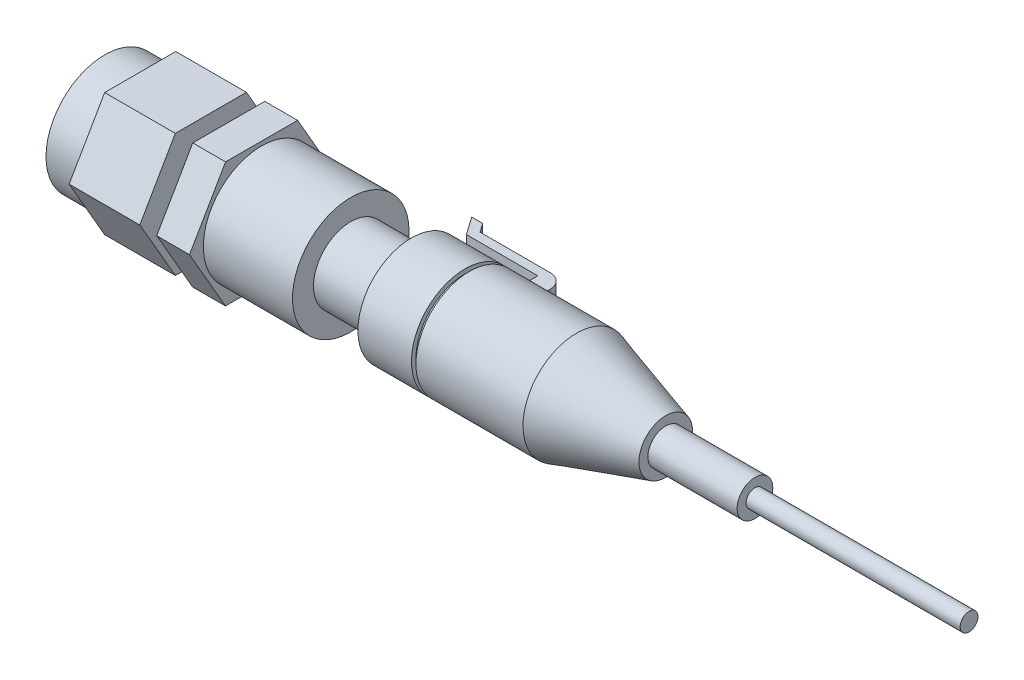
ISO-10303-21;
HEADER;
FILE_DESCRIPTION(('STEP AP214'),'2;1');
FILE_NAME('part.step','',(''),(''),'','','');
FILE_SCHEMA(('AUTOMOTIVE_DESIGN { 1 0 10303 214 1 1 1 1 }'));
ENDSEC;
DATA;
#1=APPLICATION_CONTEXT('core data for automotive mechanical design processes');
#2=APPLICATION_PROTOCOL_DEFINITION('international standard','automotive_design',2000,#1);
#3=PRODUCT_CONTEXT('',#1,'mechanical');
#4=PRODUCT('Part','Part','',(#3));
#5=PRODUCT_RELATED_PRODUCT_CATEGORY('part','',(#4));
#6=PRODUCT_DEFINITION_FORMATION('','',#4);
#7=PRODUCT_DEFINITION_CONTEXT('part definition',#1,'design');
#8=PRODUCT_DEFINITION('design','',#6,#7);
#9=PRODUCT_DEFINITION_SHAPE('','',#8);
#10=(LENGTH_UNIT() NAMED_UNIT(*) SI_UNIT(.MILLI.,.METRE.));
#11=(NAMED_UNIT(*) PLANE_ANGLE_UNIT() SI_UNIT($,.RADIAN.));
#12=(NAMED_UNIT(*) SI_UNIT($,.STERADIAN.) SOLID_ANGLE_UNIT());
#13=UNCERTAINTY_MEASURE_WITH_UNIT(LENGTH_MEASURE(1.E-05),#10,'distance_accuracy_value','');
#14=(GEOMETRIC_REPRESENTATION_CONTEXT(3) GLOBAL_UNCERTAINTY_ASSIGNED_CONTEXT((#13)) GLOBAL_UNIT_ASSIGNED_CONTEXT((#10,
#11,#12)) REPRESENTATION_CONTEXT('',''));
#15=CARTESIAN_POINT('',(0.,0.,0.));
#16=DIRECTION('',(0.,0.,1.));
#17=DIRECTION('',(1.,0.,0.));
#18=AXIS2_PLACEMENT_3D('',#15,#16,#17);
#19=CARTESIAN_POINT('',(11.4510314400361,-0.79375,-12.7));
#20=DIRECTION('',(0.,-1.,0.));
#21=DIRECTION('',(0.,0.,-1.));
#22=AXIS2_PLACEMENT_3D('',#19,#20,#21);
#23=PLANE('',#22);
#24=DIRECTION('',(1.,0.,0.));
#25=VECTOR('',#24,1.);
#26=CARTESIAN_POINT('',(11.4510314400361,-0.79375,-9.525));
#27=LINE('',#26,#25);
#28=CARTESIAN_POINT('',(11.4510314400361,-0.79375,-9.525));
#29=VERTEX_POINT('',#28);
#30=CARTESIAN_POINT('',(12.2447814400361,-0.79375,-9.525));
#31=VERTEX_POINT('',#30);
#32=EDGE_CURVE('E114',#29,#31,#27,.T.);
#33=ORIENTED_EDGE('',*,*,#32,.F.);
#34=DIRECTION('',(0.,0.,1.));
#35=VECTOR('',#34,1.);
#36=CARTESIAN_POINT('',(11.4510314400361,-0.79375,-12.7));
#37=LINE('',#36,#35);
#38=CARTESIAN_POINT('',(11.4510314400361,-0.79375,-12.7));
#39=VERTEX_POINT('',#38);
#40=EDGE_CURVE('E12',#39,#29,#37,.T.);
#41=ORIENTED_EDGE('',*,*,#40,.F.);
#42=DIRECTION('',(1.,0.,0.));
#43=VECTOR('',#42,1.);
#44=CARTESIAN_POINT('',(11.4510314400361,-0.79375,-12.7));
#45=LINE('',#44,#43);
#46=CARTESIAN_POINT('',(12.2447814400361,-0.79375,-12.7));
#47=VERTEX_POINT('',#46);
#48=EDGE_CURVE('E108',#39,#47,#45,.T.);
#49=ORIENTED_EDGE('',*,*,#48,.T.);
#50=DIRECTION('',(0.,0.,1.));
#51=VECTOR('',#50,1.);
#52=CARTESIAN_POINT('',(12.2447814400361,-0.79375,-12.7));
#53=LINE('',#52,#51);
#54=EDGE_CURVE('E53',#47,#31,#53,.T.);
#55=ORIENTED_EDGE('',*,*,#54,.T.);
#56=EDGE_LOOP('',(#33,#41,#49,#55));
#57=FACE_BOUND('',#56,.T.);
#58=ADVANCED_FACE('F50',(#57),#23,.T.);
#59=CARTESIAN_POINT('',(11.4510314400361,0.79375,-12.7));
#60=DIRECTION('',(-1.,0.,0.));
#61=DIRECTION('',(0.,-1.,0.));
#62=AXIS2_PLACEMENT_3D('',#59,#60,#61);
#63=PLANE('',#62);
#64=DIRECTION('',(0.,-1.,0.));
#65=VECTOR('',#64,1.);
#66=CARTESIAN_POINT('',(11.4510314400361,0.79375,-9.525));
#67=LINE('',#66,#65);
#68=CARTESIAN_POINT('',(11.4510314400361,0.79375,-9.525));
#69=VERTEX_POINT('',#68);
#70=EDGE_CURVE('E110',#69,#29,#67,.T.);
#71=ORIENTED_EDGE('',*,*,#70,.F.);
#72=DIRECTION('',(0.,0.,1.));
#73=VECTOR('',#72,1.);
#74=CARTESIAN_POINT('',(11.4510314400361,0.79375,-12.7));
#75=LINE('',#74,#73);
#76=CARTESIAN_POINT('',(11.4510314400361,0.79375,-12.7));
#77=VERTEX_POINT('',#76);
#78=EDGE_CURVE('E59',#77,#69,#75,.T.);
#79=ORIENTED_EDGE('',*,*,#78,.F.);
#80=DIRECTION('',(0.,-1.,0.));
#81=VECTOR('',#80,1.);
#82=CARTESIAN_POINT('',(11.4510314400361,0.79375,-12.7));
#83=LINE('',#82,#81);
#84=EDGE_CURVE('E105',#77,#39,#83,.T.);
#85=ORIENTED_EDGE('',*,*,#84,.T.);
#86=ORIENTED_EDGE('',*,*,#40,.T.);
#87=EDGE_LOOP('',(#71,#79,#85,#86));
#88=FACE_BOUND('',#87,.T.);
#89=ADVANCED_FACE('F124',(#88),#63,.T.);
#90=CARTESIAN_POINT('',(11.4510314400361,0.79375,-12.7));
#91=DIRECTION('',(0.,1.,0.));
#92=DIRECTION('',(0.,0.,1.));
#93=AXIS2_PLACEMENT_3D('',#90,#91,#92);
#94=PLANE('',#93);
#95=DIRECTION('',(-1.,0.,0.));
#96=VECTOR('',#95,1.);
#97=CARTESIAN_POINT('',(11.4510314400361,0.79375,-9.525));
#98=LINE('',#97,#96);
#99=CARTESIAN_POINT('',(12.2447814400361,0.79375,-9.525));
#100=VERTEX_POINT('',#99);
#101=EDGE_CURVE('E100',#100,#69,#98,.T.);
#102=ORIENTED_EDGE('',*,*,#101,.F.);
#103=DIRECTION('',(0.,0.,1.));
#104=VECTOR('',#103,1.);
#105=CARTESIAN_POINT('',(12.2447814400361,0.79375,-12.7));
#106=LINE('',#105,#104);
#107=CARTESIAN_POINT('',(12.2447814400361,0.79375,-12.7));
#108=VERTEX_POINT('',#107);
#109=EDGE_CURVE('E95',#108,#100,#106,.T.);
#110=ORIENTED_EDGE('',*,*,#109,.F.);
#111=DIRECTION('',(-1.,0.,0.));
#112=VECTOR('',#111,1.);
#113=CARTESIAN_POINT('',(11.4510314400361,0.79375,-12.7));
#114=LINE('',#113,#112);
#115=EDGE_CURVE('E98',#108,#77,#114,.T.);
#116=ORIENTED_EDGE('',*,*,#115,.T.);
#117=ORIENTED_EDGE('',*,*,#78,.T.);
#118=EDGE_LOOP('',(#102,#110,#116,#117));
#119=FACE_BOUND('',#118,.T.);
#120=ADVANCED_FACE('F97',(#119),#94,.T.);
#121=CARTESIAN_POINT('',(12.2447814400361,-0.79375,-12.7));
#122=DIRECTION('',(1.,0.,0.));
#123=DIRECTION('',(0.,1.,0.));
#124=AXIS2_PLACEMENT_3D('',#121,#122,#123);
#125=PLANE('',#124);
#126=DIRECTION('',(0.,1.,0.));
#127=VECTOR('',#126,1.);
#128=CARTESIAN_POINT('',(12.2447814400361,-0.79375,-9.525));
#129=LINE('',#128,#127);
#130=EDGE_CURVE('E117',#31,#100,#129,.T.);
#131=ORIENTED_EDGE('',*,*,#130,.F.);
#132=ORIENTED_EDGE('',*,*,#54,.F.);
#133=DIRECTION('',(0.,1.,0.));
#134=VECTOR('',#133,1.);
#135=CARTESIAN_POINT('',(12.2447814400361,-0.79375,-12.7));
#136=LINE('',#135,#134);
#137=EDGE_CURVE('E104',#47,#108,#136,.T.);
#138=ORIENTED_EDGE('',*,*,#137,.T.);
#139=ORIENTED_EDGE('',*,*,#109,.T.);
#140=EDGE_LOOP('',(#131,#132,#138,#139));
#141=FACE_BOUND('',#140,.T.);
#142=ADVANCED_FACE('F107',(#141),#125,.T.);
#143=CARTESIAN_POINT('',(0.,0.,-12.7));
#144=DIRECTION('',(0.,0.,1.));
#145=DIRECTION('',(1.,0.,0.));
#146=AXIS2_PLACEMENT_3D('',#143,#144,#145);
#147=PLANE('',#146);
#148=ORIENTED_EDGE('',*,*,#48,.F.);
#149=ORIENTED_EDGE('',*,*,#84,.F.);
#150=ORIENTED_EDGE('',*,*,#115,.F.);
#151=ORIENTED_EDGE('',*,*,#137,.F.);
#152=EDGE_LOOP('',(#148,#149,#150,#151));
#153=FACE_BOUND('',#152,.T.);
#154=ADVANCED_FACE('F103',(#153),#147,.F.);
#155=CARTESIAN_POINT('',(0.,0.,-9.525));
#156=DIRECTION('',(0.,0.,1.));
#157=DIRECTION('',(1.,0.,0.));
#158=AXIS2_PLACEMENT_3D('',#155,#156,#157);
#159=PLANE('',#158);
#160=ORIENTED_EDGE('',*,*,#32,.T.);
#161=ORIENTED_EDGE('',*,*,#130,.T.);
#162=ORIENTED_EDGE('',*,*,#101,.T.);
#163=ORIENTED_EDGE('',*,*,#70,.T.);
#164=EDGE_LOOP('',(#160,#161,#162,#163));
#165=FACE_BOUND('',#164,.T.);
#166=ADVANCED_FACE('F123',(#165),#159,.T.);
#167=CLOSED_SHELL('',(#58,#89,#120,#142,#154,#166));
#168=MANIFOLD_SOLID_BREP('B2',#167);
#169=CARTESIAN_POINT('',(23.7456899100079,0.,-9.2075));
#170=DIRECTION('',(0.,1.,0.));
#171=DIRECTION('',(-1.,0.,0.));
#172=AXIS2_PLACEMENT_3D('',#169,#170,#171);
#173=CYLINDRICAL_SURFACE('',#172,2.54);
#174=DIRECTION('',(0.,-1.,0.));
#175=VECTOR('',#174,1.);
#176=CARTESIAN_POINT('',(23.7456899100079,0.,-11.7475));
#177=LINE('',#176,#175);
#178=CARTESIAN_POINT('',(23.7456899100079,-1.5875,-11.7475));
#179=VERTEX_POINT('',#178);
#180=CARTESIAN_POINT('',(23.7456899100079,-4.7625,-11.7475));
#181=VERTEX_POINT('',#180);
#182=EDGE_CURVE('E909',#179,#181,#177,.T.);
#183=ORIENTED_EDGE('',*,*,#182,.F.);
#184=CARTESIAN_POINT('',(23.7456899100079,-1.5875,-9.2075));
#185=DIRECTION('',(0.,-1.,0.));
#186=DIRECTION('',(1.,0.,0.));
#187=AXIS2_PLACEMENT_3D('',#184,#185,#186);
#188=CIRCLE('',#187,2.54);
#189=CARTESIAN_POINT('',(26.2856899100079,-1.5875,-9.2075));
#190=VERTEX_POINT('',#189);
#191=EDGE_CURVE('E181',#190,#179,#188,.F.);
#192=ORIENTED_EDGE('',*,*,#191,.F.);
#193=DIRECTION('',(0.,-1.,0.));
#194=VECTOR('',#193,1.);
#195=CARTESIAN_POINT('',(26.2856899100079,0.,-9.2075));
#196=LINE('',#195,#194);
#197=CARTESIAN_POINT('',(26.2856899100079,-4.7625,-9.2075));
#198=VERTEX_POINT('',#197);
#199=EDGE_CURVE('E913',#198,#190,#196,.F.);
#200=ORIENTED_EDGE('',*,*,#199,.F.);
#201=CARTESIAN_POINT('',(23.7456899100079,-4.7625,-9.2075));
#202=DIRECTION('',(0.,1.,0.));
#203=DIRECTION('',(-1.,0.,0.));
#204=AXIS2_PLACEMENT_3D('',#201,#202,#203);
#205=CIRCLE('',#204,2.54);
#206=EDGE_CURVE('E48',#181,#198,#205,.F.);
#207=ORIENTED_EDGE('',*,*,#206,.F.);
#208=EDGE_LOOP('',(#183,#192,#200,#207));
#209=FACE_BOUND('',#208,.T.);
#210=ADVANCED_FACE('F173',(#209),#173,.T.);
#211=CARTESIAN_POINT('',(23.7456899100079,0.,-9.2075));
#212=DIRECTION('',(0.,-1.,0.));
#213=DIRECTION('',(1.,0.,0.));
#214=AXIS2_PLACEMENT_3D('',#211,#212,#213);
#215=CYLINDRICAL_SURFACE('',#214,2.54);
#216=DIRECTION('',(0.,-1.,0.));
#217=VECTOR('',#216,1.);
#218=CARTESIAN_POINT('',(23.7456899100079,0.,-11.7475));
#219=LINE('',#218,#217);
#220=CARTESIAN_POINT('',(23.7456899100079,4.7625,-11.7475));
#221=VERTEX_POINT('',#220);
#222=CARTESIAN_POINT('',(23.7456899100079,1.5875,-11.7475));
#223=VERTEX_POINT('',#222);
#224=EDGE_CURVE('E894',#221,#223,#219,.T.);
#225=ORIENTED_EDGE('',*,*,#224,.F.);
#226=CARTESIAN_POINT('',(23.7456899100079,4.7625,-9.2075));
#227=DIRECTION('',(0.,-1.,0.));
#228=DIRECTION('',(1.,0.,0.));
#229=AXIS2_PLACEMENT_3D('',#226,#227,#228);
#230=CIRCLE('',#229,2.54);
#231=CARTESIAN_POINT('',(26.2856899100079,4.7625,-9.2075));
#232=VERTEX_POINT('',#231);
#233=EDGE_CURVE('E903',#232,#221,#230,.F.);
#234=ORIENTED_EDGE('',*,*,#233,.F.);
#235=DIRECTION('',(0.,-1.,0.));
#236=VECTOR('',#235,1.);
#237=CARTESIAN_POINT('',(26.2856899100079,1.5875,-9.2075));
#238=LINE('',#237,#236);
#239=CARTESIAN_POINT('',(26.2856899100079,1.5875,-9.2075));
#240=VERTEX_POINT('',#239);
#241=EDGE_CURVE('E898',#240,#232,#238,.F.);
#242=ORIENTED_EDGE('',*,*,#241,.F.);
#243=CARTESIAN_POINT('',(23.7456899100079,1.5875,-9.2075));
#244=DIRECTION('',(0.,1.,0.));
#245=DIRECTION('',(-1.,0.,0.));
#246=AXIS2_PLACEMENT_3D('',#243,#244,#245);
#247=CIRCLE('',#246,2.54);
#248=EDGE_CURVE('E906',#223,#240,#247,.F.);
#249=ORIENTED_EDGE('',*,*,#248,.F.);
#250=EDGE_LOOP('',(#225,#234,#242,#249));
#251=FACE_BOUND('',#250,.T.);
#252=ADVANCED_FACE('F961',(#251),#215,.T.);
#253=CARTESIAN_POINT('',(23.1106899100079,-1.5875,-11.7475));
#254=DIRECTION('',(0.,-1.,0.));
#255=DIRECTION('',(1.,0.,0.));
#256=AXIS2_PLACEMENT_3D('',#253,#254,#255);
#257=PLANE('',#256);
#258=DIRECTION('',(0.,0.,1.));
#259=VECTOR('',#258,1.);
#260=CARTESIAN_POINT('',(26.2856899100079,-1.5875,-11.7475));
#261=LINE('',#260,#259);
#262=CARTESIAN_POINT('',(26.2856899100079,-1.5875,-5.3975));
#263=VERTEX_POINT('',#262);
#264=EDGE_CURVE('E609',#190,#263,#261,.T.);
#265=ORIENTED_EDGE('',*,*,#264,.F.);
#266=ORIENTED_EDGE('',*,*,#191,.T.);
#267=DIRECTION('',(1.,0.,0.));
#268=VECTOR('',#267,1.);
#269=CARTESIAN_POINT('',(23.1106899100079,-1.5875,-11.7475));
#270=LINE('',#269,#268);
#271=CARTESIAN_POINT('',(11.2525939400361,-1.58749999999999,-11.7475));
#272=VERTEX_POINT('',#271);
#273=EDGE_CURVE('E578',#272,#179,#270,.T.);
#274=ORIENTED_EDGE('',*,*,#273,.F.);
#275=DIRECTION('',(0.57357643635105,0.,0.819152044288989));
#276=VECTOR('',#275,1.);
#277=CARTESIAN_POINT('',(12.364173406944,-1.5875,-10.16));
#278=LINE('',#277,#276);
#279=CARTESIAN_POINT('',(10.9546339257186,-1.5875,-12.1730310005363));
#280=VERTEX_POINT('',#279);
#281=EDGE_CURVE('E490',#280,#272,#278,.T.);
#282=ORIENTED_EDGE('',*,*,#281,.F.);
#283=DIRECTION('',(1.,0.,0.));
#284=VECTOR('',#283,1.);
#285=CARTESIAN_POINT('',(23.1106899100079,-1.5875,-12.1730310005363));
#286=LINE('',#285,#284);
#287=CARTESIAN_POINT('',(9.00115042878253,-1.58749999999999,-12.1730310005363));
#288=VERTEX_POINT('',#287);
#289=EDGE_CURVE('E444',#288,#280,#286,.T.);
#290=ORIENTED_EDGE('',*,*,#289,.F.);
#291=DIRECTION('',(-0.57357643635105,0.,-0.819152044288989));
#292=VECTOR('',#291,1.);
#293=CARTESIAN_POINT('',(10.4106899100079,-1.5875,-10.16));
#294=LINE('',#293,#292);
#295=CARTESIAN_POINT('',(10.4106899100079,-1.5875,-10.16));
#296=VERTEX_POINT('',#295);
#297=EDGE_CURVE('E486',#296,#288,#294,.T.);
#298=ORIENTED_EDGE('',*,*,#297,.F.);
#299=DIRECTION('',(1.,0.,0.));
#300=VECTOR('',#299,1.);
#301=CARTESIAN_POINT('',(10.4106899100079,-1.5875,-10.16));
#302=LINE('',#301,#300);
#303=CARTESIAN_POINT('',(23.1106899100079,-1.5875,-10.16));
#304=VERTEX_POINT('',#303);
#305=EDGE_CURVE('E533',#296,#304,#302,.T.);
#306=ORIENTED_EDGE('',*,*,#305,.T.);
#307=DIRECTION('',(0.,0.,1.));
#308=VECTOR('',#307,1.);
#309=CARTESIAN_POINT('',(23.1106899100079,-1.5875,-11.7475));
#310=LINE('',#309,#308);
#311=CARTESIAN_POINT('',(23.1106899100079,-1.5875,-5.3975));
#312=VERTEX_POINT('',#311);
#313=EDGE_CURVE('E586',#304,#312,#310,.T.);
#314=ORIENTED_EDGE('',*,*,#313,.T.);
#315=DIRECTION('',(1.,0.,0.));
#316=VECTOR('',#315,1.);
#317=CARTESIAN_POINT('',(23.1106899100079,-1.5875,-5.3975));
#318=LINE('',#317,#316);
#319=EDGE_CURVE('E577',#312,#263,#318,.T.);
#320=ORIENTED_EDGE('',*,*,#319,.T.);
#321=EDGE_LOOP('',(#265,#266,#274,#282,#290,#298,#306,#314,#320));
#322=FACE_BOUND('',#321,.T.);
#323=ADVANCED_FACE('F919',(#322),#257,.F.);
#324=CARTESIAN_POINT('',(23.1106899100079,1.5875,-11.7475));
#325=DIRECTION('',(0.,1.,0.));
#326=DIRECTION('',(-1.,0.,0.));
#327=AXIS2_PLACEMENT_3D('',#324,#325,#326);
#328=PLANE('',#327);
#329=DIRECTION('',(-1.,0.,0.));
#330=VECTOR('',#329,1.);
#331=CARTESIAN_POINT('',(23.1106899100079,1.5875,-11.7475));
#332=LINE('',#331,#330);
#333=CARTESIAN_POINT('',(11.2525939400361,1.58749999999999,-11.7475));
#334=VERTEX_POINT('',#333);
#335=EDGE_CURVE('E547',#223,#334,#332,.T.);
#336=ORIENTED_EDGE('',*,*,#335,.F.);
#337=ORIENTED_EDGE('',*,*,#248,.T.);
#338=DIRECTION('',(0.,0.,1.));
#339=VECTOR('',#338,1.);
#340=CARTESIAN_POINT('',(26.2856899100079,1.5875,-11.7475));
#341=LINE('',#340,#339);
#342=CARTESIAN_POINT('',(26.2856899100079,1.5875,-5.3975));
#343=VERTEX_POINT('',#342);
#344=EDGE_CURVE('E571',#240,#343,#341,.T.);
#345=ORIENTED_EDGE('',*,*,#344,.T.);
#346=DIRECTION('',(-1.,0.,0.));
#347=VECTOR('',#346,1.);
#348=CARTESIAN_POINT('',(23.1106899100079,1.5875,-5.3975));
#349=LINE('',#348,#347);
#350=CARTESIAN_POINT('',(23.1106899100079,1.5875,-5.3975));
#351=VERTEX_POINT('',#350);
#352=EDGE_CURVE('E559',#343,#351,#349,.T.);
#353=ORIENTED_EDGE('',*,*,#352,.T.);
#354=DIRECTION('',(0.,0.,1.));
#355=VECTOR('',#354,1.);
#356=CARTESIAN_POINT('',(23.1106899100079,1.5875,-11.7475));
#357=LINE('',#356,#355);
#358=CARTESIAN_POINT('',(23.1106899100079,1.5875,-10.16));
#359=VERTEX_POINT('',#358);
#360=EDGE_CURVE('E568',#359,#351,#357,.T.);
#361=ORIENTED_EDGE('',*,*,#360,.F.);
#362=DIRECTION('',(1.,0.,0.));
#363=VECTOR('',#362,1.);
#364=CARTESIAN_POINT('',(10.4106899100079,1.5875,-10.16));
#365=LINE('',#364,#363);
#366=CARTESIAN_POINT('',(10.4106899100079,1.5875,-10.16));
#367=VERTEX_POINT('',#366);
#368=EDGE_CURVE('E525',#367,#359,#365,.T.);
#369=ORIENTED_EDGE('',*,*,#368,.F.);
#370=DIRECTION('',(0.57357643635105,0.,0.819152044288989));
#371=VECTOR('',#370,1.);
#372=CARTESIAN_POINT('',(10.4106899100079,1.5875,-10.16));
#373=LINE('',#372,#371);
#374=CARTESIAN_POINT('',(9.00115042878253,1.58749999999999,-12.1730310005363));
#375=VERTEX_POINT('',#374);
#376=EDGE_CURVE('E459',#375,#367,#373,.T.);
#377=ORIENTED_EDGE('',*,*,#376,.F.);
#378=DIRECTION('',(-1.,0.,0.));
#379=VECTOR('',#378,1.);
#380=CARTESIAN_POINT('',(23.1106899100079,1.5875,-12.1730310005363));
#381=LINE('',#380,#379);
#382=CARTESIAN_POINT('',(10.9546339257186,1.5875,-12.1730310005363));
#383=VERTEX_POINT('',#382);
#384=EDGE_CURVE('E441',#383,#375,#381,.T.);
#385=ORIENTED_EDGE('',*,*,#384,.F.);
#386=DIRECTION('',(-0.57357643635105,0.,-0.819152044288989));
#387=VECTOR('',#386,1.);
#388=CARTESIAN_POINT('',(12.364173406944,1.5875,-10.16));
#389=LINE('',#388,#387);
#390=EDGE_CURVE('E457',#334,#383,#389,.T.);
#391=ORIENTED_EDGE('',*,*,#390,.F.);
#392=EDGE_LOOP('',(#336,#337,#345,#353,#361,#369,#377,#385,#391));
#393=FACE_BOUND('',#392,.T.);
#394=ADVANCED_FACE('F456',(#393),#328,.F.);
#395=CARTESIAN_POINT('',(23.1106899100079,4.7625,-11.7475));
#396=DIRECTION('',(1.,0.,0.));
#397=DIRECTION('',(0.,0.,-1.));
#398=AXIS2_PLACEMENT_3D('',#395,#396,#397);
#399=PLANE('',#398);
#400=DIRECTION('',(0.,1.,0.));
#401=VECTOR('',#400,1.);
#402=CARTESIAN_POINT('',(23.1106899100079,4.7625,-10.16));
#403=LINE('',#402,#401);
#404=CARTESIAN_POINT('',(23.1106899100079,4.7625,-10.16));
#405=VERTEX_POINT('',#404);
#406=EDGE_CURVE('E514',#359,#405,#403,.T.);
#407=ORIENTED_EDGE('',*,*,#406,.F.);
#408=ORIENTED_EDGE('',*,*,#360,.T.);
#409=DIRECTION('',(0.,1.,0.));
#410=VECTOR('',#409,1.);
#411=CARTESIAN_POINT('',(23.1106899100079,4.7625,-5.3975));
#412=LINE('',#411,#410);
#413=CARTESIAN_POINT('',(23.1106899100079,4.7625,-5.3975));
#414=VERTEX_POINT('',#413);
#415=EDGE_CURVE('E548',#351,#414,#412,.T.);
#416=ORIENTED_EDGE('',*,*,#415,.T.);
#417=DIRECTION('',(0.,0.,1.));
#418=VECTOR('',#417,1.);
#419=CARTESIAN_POINT('',(23.1106899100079,4.7625,-11.7475));
#420=LINE('',#419,#418);
#421=EDGE_CURVE('E551',#405,#414,#420,.T.);
#422=ORIENTED_EDGE('',*,*,#421,.F.);
#423=EDGE_LOOP('',(#407,#408,#416,#422));
#424=FACE_BOUND('',#423,.T.);
#425=ADVANCED_FACE('F1111',(#424),#399,.F.);
#426=CARTESIAN_POINT('',(23.1106899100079,-4.7625,-11.7475));
#427=DIRECTION('',(1.,0.,0.));
#428=DIRECTION('',(0.,0.,-1.));
#429=AXIS2_PLACEMENT_3D('',#426,#427,#428);
#430=PLANE('',#429);
#431=DIRECTION('',(0.,1.,0.));
#432=VECTOR('',#431,1.);
#433=CARTESIAN_POINT('',(23.1106899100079,-4.7625,-10.16));
#434=LINE('',#433,#432);
#435=CARTESIAN_POINT('',(23.1106899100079,-4.7625,-10.16));
#436=VERTEX_POINT('',#435);
#437=EDGE_CURVE('E528',#436,#304,#434,.T.);
#438=ORIENTED_EDGE('',*,*,#437,.F.);
#439=DIRECTION('',(0.,0.,1.));
#440=VECTOR('',#439,1.);
#441=CARTESIAN_POINT('',(23.1106899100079,-4.7625,-11.7475));
#442=LINE('',#441,#440);
#443=CARTESIAN_POINT('',(23.1106899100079,-4.7625,-5.3975));
#444=VERTEX_POINT('',#443);
#445=EDGE_CURVE('E603',#436,#444,#442,.T.);
#446=ORIENTED_EDGE('',*,*,#445,.T.);
#447=DIRECTION('',(0.,1.,0.));
#448=VECTOR('',#447,1.);
#449=CARTESIAN_POINT('',(23.1106899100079,-4.7625,-5.3975));
#450=LINE('',#449,#448);
#451=EDGE_CURVE('E583',#444,#312,#450,.T.);
#452=ORIENTED_EDGE('',*,*,#451,.T.);
#453=ORIENTED_EDGE('',*,*,#313,.F.);
#454=EDGE_LOOP('',(#438,#446,#452,#453));
#455=FACE_BOUND('',#454,.T.);
#456=ADVANCED_FACE('F938',(#455),#430,.F.);
#457=CARTESIAN_POINT('',(0.,0.,-5.3975));
#458=DIRECTION('',(0.,0.,1.));
#459=DIRECTION('',(1.,0.,0.));
#460=AXIS2_PLACEMENT_3D('',#457,#458,#459);
#461=PLANE('',#460);
#462=ORIENTED_EDGE('',*,*,#319,.F.);
#463=ORIENTED_EDGE('',*,*,#451,.F.);
#464=DIRECTION('',(-1.,0.,0.));
#465=VECTOR('',#464,1.);
#466=CARTESIAN_POINT('',(26.2856899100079,-4.7625,-5.3975));
#467=LINE('',#466,#465);
#468=CARTESIAN_POINT('',(26.2856899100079,-4.7625,-5.3975));
#469=VERTEX_POINT('',#468);
#470=EDGE_CURVE('E594',#469,#444,#467,.T.);
#471=ORIENTED_EDGE('',*,*,#470,.F.);
#472=DIRECTION('',(0.,-1.,0.));
#473=VECTOR('',#472,1.);
#474=CARTESIAN_POINT('',(26.2856899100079,-1.5875,-5.3975));
#475=LINE('',#474,#473);
#476=EDGE_CURVE('E590',#263,#469,#475,.T.);
#477=ORIENTED_EDGE('',*,*,#476,.F.);
#478=EDGE_LOOP('',(#462,#463,#471,#477));
#479=FACE_BOUND('',#478,.T.);
#480=DIRECTION('',(0.,-1.,0.));
#481=VECTOR('',#480,1.);
#482=CARTESIAN_POINT('',(20.32,5.84428247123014,-5.3975));
#483=LINE('',#482,#481);
#484=CARTESIAN_POINT('',(20.32,5.84428247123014,-5.3975));
#485=VERTEX_POINT('',#484);
#486=CARTESIAN_POINT('',(20.32,1.41054551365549,-5.3975));
#487=VERTEX_POINT('',#486);
#488=EDGE_CURVE('E648',#485,#487,#483,.T.);
#489=ORIENTED_EDGE('',*,*,#488,.F.);
#490=DIRECTION('',(-1.,0.,0.));
#491=VECTOR('',#490,1.);
#492=CARTESIAN_POINT('',(27.46375,5.84428247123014,-5.3975));
#493=LINE('',#492,#491);
#494=CARTESIAN_POINT('',(27.46375,5.84428247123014,-5.3975));
#495=VERTEX_POINT('',#494);
#496=EDGE_CURVE('E670',#495,#485,#493,.T.);
#497=ORIENTED_EDGE('',*,*,#496,.F.);
#498=DIRECTION('',(0.,1.,0.));
#499=VECTOR('',#498,1.);
#500=CARTESIAN_POINT('',(27.46375,5.84428247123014,-5.3975));
#501=LINE('',#500,#499);
#502=CARTESIAN_POINT('',(27.46375,-5.84428247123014,-5.3975));
#503=VERTEX_POINT('',#502);
#504=EDGE_CURVE('E667',#503,#495,#501,.T.);
#505=ORIENTED_EDGE('',*,*,#504,.F.);
#506=DIRECTION('',(1.,0.,0.));
#507=VECTOR('',#506,1.);
#508=CARTESIAN_POINT('',(27.46375,-5.84428247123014,-5.3975));
#509=LINE('',#508,#507);
#510=CARTESIAN_POINT('',(20.32,-5.84428247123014,-5.3975));
#511=VERTEX_POINT('',#510);
#512=EDGE_CURVE('E664',#511,#503,#509,.T.);
#513=ORIENTED_EDGE('',*,*,#512,.F.);
#514=DIRECTION('',(0.,-1.,0.));
#515=VECTOR('',#514,1.);
#516=CARTESIAN_POINT('',(20.32,-5.84428247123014,-5.3975));
#517=LINE('',#516,#515);
#518=CARTESIAN_POINT('',(20.32,-1.41054551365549,-5.3975));
#519=VERTEX_POINT('',#518);
#520=EDGE_CURVE('E661',#519,#511,#517,.T.);
#521=ORIENTED_EDGE('',*,*,#520,.F.);
#522=DIRECTION('',(-1.,0.,0.));
#523=VECTOR('',#522,1.);
#524=CARTESIAN_POINT('',(20.32,-1.41054551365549,-5.3975));
#525=LINE('',#524,#523);
#526=CARTESIAN_POINT('',(23.495,-1.41054551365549,-5.3975));
#527=VERTEX_POINT('',#526);
#528=EDGE_CURVE('E658',#527,#519,#525,.T.);
#529=ORIENTED_EDGE('',*,*,#528,.F.);
#530=DIRECTION('',(0.,-1.,0.));
#531=VECTOR('',#530,1.);
#532=CARTESIAN_POINT('',(23.495,-1.41054551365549,-5.3975));
#533=LINE('',#532,#531);
#534=CARTESIAN_POINT('',(23.495,1.41054551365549,-5.3975));
#535=VERTEX_POINT('',#534);
#536=EDGE_CURVE('E655',#535,#527,#533,.T.);
#537=ORIENTED_EDGE('',*,*,#536,.F.);
#538=DIRECTION('',(1.,0.,0.));
#539=VECTOR('',#538,1.);
#540=CARTESIAN_POINT('',(20.32,1.41054551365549,-5.3975));
#541=LINE('',#540,#539);
#542=EDGE_CURVE('E652',#487,#535,#541,.T.);
#543=ORIENTED_EDGE('',*,*,#542,.F.);
#544=EDGE_LOOP('',(#489,#497,#505,#513,#521,#529,#537,#543));
#545=FACE_BOUND('',#544,.T.);
#546=DIRECTION('',(1.,0.,0.));
#547=VECTOR('',#546,1.);
#548=CARTESIAN_POINT('',(26.2856899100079,4.7625,-5.3975));
#549=LINE('',#548,#547);
#550=CARTESIAN_POINT('',(26.2856899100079,4.7625,-5.3975));
#551=VERTEX_POINT('',#550);
#552=EDGE_CURVE('E542',#414,#551,#549,.T.);
#553=ORIENTED_EDGE('',*,*,#552,.F.);
#554=ORIENTED_EDGE('',*,*,#415,.F.);
#555=ORIENTED_EDGE('',*,*,#352,.F.);
#556=DIRECTION('',(0.,-1.,0.));
#557=VECTOR('',#556,1.);
#558=CARTESIAN_POINT('',(26.2856899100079,1.5875,-5.3975));
#559=LINE('',#558,#557);
#560=EDGE_CURVE('E555',#551,#343,#559,.T.);
#561=ORIENTED_EDGE('',*,*,#560,.F.);
#562=EDGE_LOOP('',(#553,#554,#555,#561));
#563=FACE_BOUND('',#562,.T.);
#564=ADVANCED_FACE('F942',(#479,#545,#563),#461,.F.);
#565=CARTESIAN_POINT('',(21.11375,0.,0.));
#566=DIRECTION('',(1.,0.,0.));
#567=DIRECTION('',(0.,0.,-1.));
#568=AXIS2_PLACEMENT_3D('',#565,#566,#567);
#569=PLANE('',#568);
#570=CARTESIAN_POINT('',(21.11375,0.,0.));
#571=DIRECTION('',(1.,0.,0.));
#572=DIRECTION('',(0.,0.,-1.));
#573=AXIS2_PLACEMENT_3D('',#570,#571,#572);
#574=CIRCLE('',#573,9.525);
#575=CARTESIAN_POINT('',(21.11375,5.84428247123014,-7.52130224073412));
#576=VERTEX_POINT('',#575);
#577=CARTESIAN_POINT('',(21.11375,-5.84428247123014,-7.52130224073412));
#578=VERTEX_POINT('',#577);
#579=EDGE_CURVE('E710',#576,#578,#574,.T.);
#580=ORIENTED_EDGE('',*,*,#579,.F.);
#581=DIRECTION('',(0.,0.,-1.));
#582=VECTOR('',#581,1.);
#583=CARTESIAN_POINT('',(21.11375,5.84428247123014,0.));
#584=LINE('',#583,#582);
#585=CARTESIAN_POINT('',(21.11375,5.84428247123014,-6.49538421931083));
#586=VERTEX_POINT('',#585);
#587=EDGE_CURVE('E890',#586,#576,#584,.T.);
#588=ORIENTED_EDGE('',*,*,#587,.F.);
#589=CARTESIAN_POINT('',(21.11375,0.,0.));
#590=DIRECTION('',(1.,0.,0.));
#591=DIRECTION('',(0.,0.,-1.));
#592=AXIS2_PLACEMENT_3D('',#589,#590,#591);
#593=CIRCLE('',#592,8.7376);
#594=CARTESIAN_POINT('',(21.11375,-5.84428247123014,-6.49538421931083));
#595=VERTEX_POINT('',#594);
#596=EDGE_CURVE('E717',#586,#595,#593,.T.);
#597=ORIENTED_EDGE('',*,*,#596,.T.);
#598=DIRECTION('',(0.,0.,1.));
#599=VECTOR('',#598,1.);
#600=CARTESIAN_POINT('',(21.11375,-5.84428247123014,0.));
#601=LINE('',#600,#599);
#602=EDGE_CURVE('E887',#578,#595,#601,.T.);
#603=ORIENTED_EDGE('',*,*,#602,.F.);
#604=EDGE_LOOP('',(#580,#588,#597,#603));
#605=FACE_BOUND('',#604,.T.);
#606=ADVANCED_FACE('F1086',(#605),#569,.F.);
#607=CARTESIAN_POINT('',(40.16375,0.,0.));
#608=DIRECTION('',(-1.,0.,0.));
#609=DIRECTION('',(0.,0.,1.));
#610=AXIS2_PLACEMENT_3D('',#607,#608,#609);
#611=CYLINDRICAL_SURFACE('',#610,9.525);
#612=CARTESIAN_POINT('',(40.16375,0.,0.));
#613=DIRECTION('',(1.,0.,0.));
#614=DIRECTION('',(0.,0.,-1.));
#615=AXIS2_PLACEMENT_3D('',#612,#613,#614);
#616=CIRCLE('',#615,9.525);
#617=CARTESIAN_POINT('',(40.16375,0.,-9.525));
#618=VERTEX_POINT('',#617);
#619=EDGE_CURVE('E705',#618,#618,#616,.T.);
#620=ORIENTED_EDGE('',*,*,#619,.F.);
#621=EDGE_LOOP('',(#620));
#622=FACE_BOUND('',#621,.T.);
#623=CARTESIAN_POINT('',(27.46375,0.,0.));
#624=DIRECTION('',(1.,0.,0.));
#625=DIRECTION('',(0.,1.,0.));
#626=AXIS2_PLACEMENT_3D('',#623,#624,#625);
#627=CIRCLE('',#626,9.525);
#628=CARTESIAN_POINT('',(27.46375,5.84428247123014,-7.52130224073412));
#629=VERTEX_POINT('',#628);
#630=CARTESIAN_POINT('',(27.46375,-5.84428247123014,-7.52130224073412));
#631=VERTEX_POINT('',#630);
#632=EDGE_CURVE('E637',#629,#631,#627,.F.);
#633=ORIENTED_EDGE('',*,*,#632,.F.);
#634=DIRECTION('',(-1.,0.,0.));
#635=VECTOR('',#634,1.);
#636=CARTESIAN_POINT('',(40.16375,5.84428247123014,-7.52130224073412));
#637=LINE('',#636,#635);
#638=EDGE_CURVE('E641',#576,#629,#637,.F.);
#639=ORIENTED_EDGE('',*,*,#638,.F.);
#640=ORIENTED_EDGE('',*,*,#579,.T.);
#641=DIRECTION('',(-1.,0.,0.));
#642=VECTOR('',#641,1.);
#643=CARTESIAN_POINT('',(40.16375,-5.84428247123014,-7.52130224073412));
#644=LINE('',#643,#642);
#645=EDGE_CURVE('E633',#631,#578,#644,.T.);
#646=ORIENTED_EDGE('',*,*,#645,.F.);
#647=EDGE_LOOP('',(#633,#639,#640,#646));
#648=FACE_BOUND('',#647,.T.);
#649=ADVANCED_FACE('F1077',(#622,#648),#611,.T.);
#650=CARTESIAN_POINT('',(21.11375,0.,0.));
#651=DIRECTION('',(-1.,0.,0.));
#652=DIRECTION('',(0.,0.,1.));
#653=AXIS2_PLACEMENT_3D('',#650,#651,#652);
#654=CYLINDRICAL_SURFACE('',#653,8.7376);
#655=DIRECTION('',(-1.,0.,0.));
#656=VECTOR('',#655,1.);
#657=CARTESIAN_POINT('',(21.11375,-5.84428247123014,-6.49538421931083));
#658=LINE('',#657,#656);
#659=CARTESIAN_POINT('',(20.32,-5.84428247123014,-6.49538421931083));
#660=VERTEX_POINT('',#659);
#661=EDGE_CURVE('E701',#595,#660,#658,.T.);
#662=ORIENTED_EDGE('',*,*,#661,.F.);
#663=ORIENTED_EDGE('',*,*,#596,.F.);
#664=DIRECTION('',(-1.,0.,0.));
#665=VECTOR('',#664,1.);
#666=CARTESIAN_POINT('',(21.11375,5.84428247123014,-6.49538421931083));
#667=LINE('',#666,#665);
#668=CARTESIAN_POINT('',(20.32,5.84428247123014,-6.49538421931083));
#669=VERTEX_POINT('',#668);
#670=EDGE_CURVE('E698',#669,#586,#667,.F.);
#671=ORIENTED_EDGE('',*,*,#670,.F.);
#672=CARTESIAN_POINT('',(20.32,0.,0.));
#673=DIRECTION('',(1.,0.,0.));
#674=DIRECTION('',(0.,0.,-1.));
#675=AXIS2_PLACEMENT_3D('',#672,#673,#674);
#676=CIRCLE('',#675,8.7376);
#677=EDGE_CURVE('E722',#669,#660,#676,.T.);
#678=ORIENTED_EDGE('',*,*,#677,.T.);
#679=EDGE_LOOP('',(#662,#663,#671,#678));
#680=FACE_BOUND('',#679,.T.);
#681=ADVANCED_FACE('F1073',(#680),#654,.T.);
#682=CARTESIAN_POINT('',(21.11375,-1.41054551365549,-8.62299339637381));
#683=VERTEX_POINT('',#682);
#684=CARTESIAN_POINT('',(21.11375,1.41054551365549,-8.62299339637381));
#685=VERTEX_POINT('',#684);
#686=EDGE_CURVE('E709',#683,#685,#593,.T.);
#687=ORIENTED_EDGE('',*,*,#686,.F.);
#688=DIRECTION('',(-1.,0.,0.));
#689=VECTOR('',#688,1.);
#690=CARTESIAN_POINT('',(21.11375,-1.41054551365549,-8.62299339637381));
#691=LINE('',#690,#689);
#692=CARTESIAN_POINT('',(20.32,-1.41054551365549,-8.62299339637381));
#693=VERTEX_POINT('',#692);
#694=EDGE_CURVE('E622',#693,#683,#691,.F.);
#695=ORIENTED_EDGE('',*,*,#694,.F.);
#696=CARTESIAN_POINT('',(20.32,1.41054551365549,-8.62299339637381));
#697=VERTEX_POINT('',#696);
#698=EDGE_CURVE('E718',#693,#697,#676,.T.);
#699=ORIENTED_EDGE('',*,*,#698,.T.);
#700=DIRECTION('',(-1.,0.,0.));
#701=VECTOR('',#700,1.);
#702=CARTESIAN_POINT('',(21.11375,1.41054551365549,-8.62299339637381));
#703=LINE('',#702,#701);
#704=EDGE_CURVE('E618',#685,#697,#703,.T.);
#705=ORIENTED_EDGE('',*,*,#704,.F.);
#706=EDGE_LOOP('',(#687,#695,#699,#705));
#707=FACE_BOUND('',#706,.T.);
#708=ADVANCED_FACE('F1076',(#707),#654,.T.);
#709=CARTESIAN_POINT('',(21.11375,-1.41054551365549,-9.41997804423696));
#710=VERTEX_POINT('',#709);
#711=CARTESIAN_POINT('',(21.11375,1.41054551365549,-9.41997804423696));
#712=VERTEX_POINT('',#711);
#713=EDGE_CURVE('E704',#710,#712,#574,.T.);
#714=ORIENTED_EDGE('',*,*,#713,.F.);
#715=DIRECTION('',(0.,0.,-1.));
#716=VECTOR('',#715,1.);
#717=CARTESIAN_POINT('',(21.11375,-1.41054551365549,-12.817938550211));
#718=LINE('',#717,#716);
#719=EDGE_CURVE('E615',#683,#710,#718,.T.);
#720=ORIENTED_EDGE('',*,*,#719,.F.);
#721=ORIENTED_EDGE('',*,*,#686,.T.);
#722=DIRECTION('',(0.,0.,1.));
#723=VECTOR('',#722,1.);
#724=CARTESIAN_POINT('',(21.11375,1.41054551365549,-12.817938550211));
#725=LINE('',#724,#723);
#726=EDGE_CURVE('E612',#712,#685,#725,.T.);
#727=ORIENTED_EDGE('',*,*,#726,.F.);
#728=EDGE_LOOP('',(#714,#720,#721,#727));
#729=FACE_BOUND('',#728,.T.);
#730=ADVANCED_FACE('F975',(#729),#569,.F.);
#731=CARTESIAN_POINT('',(-15.875,0.,0.));
#732=DIRECTION('',(1.,0.,0.));
#733=DIRECTION('',(0.,0.,-1.));
#734=AXIS2_PLACEMENT_3D('',#731,#732,#733);
#735=CYLINDRICAL_SURFACE('',#734,10.3632);
#736=CARTESIAN_POINT('',(-15.875,0.,0.));
#737=DIRECTION('',(1.,0.,0.));
#738=DIRECTION('',(0.,0.,-1.));
#739=AXIS2_PLACEMENT_3D('',#736,#737,#738);
#740=CIRCLE('',#739,10.3632);
#741=CARTESIAN_POINT('',(-15.875,0.,-10.3632));
#742=VERTEX_POINT('',#741);
#743=EDGE_CURVE('E880',#742,#742,#740,.T.);
#744=ORIENTED_EDGE('',*,*,#743,.T.);
#745=EDGE_LOOP('',(#744));
#746=FACE_BOUND('',#745,.T.);
#747=CARTESIAN_POINT('',(0.,0.,0.));
#748=DIRECTION('',(1.,0.,0.));
#749=DIRECTION('',(0.,0.,-1.));
#750=AXIS2_PLACEMENT_3D('',#747,#748,#749);
#751=CIRCLE('',#750,10.3632);
#752=CARTESIAN_POINT('',(0.,0.,-10.3632));
#753=VERTEX_POINT('',#752);
#754=EDGE_CURVE('E818',#753,#753,#751,.T.);
#755=ORIENTED_EDGE('',*,*,#754,.F.);
#756=EDGE_LOOP('',(#755));
#757=FACE_BOUND('',#756,.T.);
#758=ADVANCED_FACE('F971',(#746,#757),#735,.T.);
#759=CARTESIAN_POINT('',(0.,0.,0.));
#760=DIRECTION('',(1.,0.,0.));
#761=DIRECTION('',(0.,0.,-1.));
#762=AXIS2_PLACEMENT_3D('',#759,#760,#761);
#763=PLANE('',#762);
#764=CARTESIAN_POINT('',(0.,0.,0.));
#765=DIRECTION('',(1.,0.,0.));
#766=DIRECTION('',(0.,0.,-1.));
#767=AXIS2_PLACEMENT_3D('',#764,#765,#766);
#768=CIRCLE('',#767,6.63575);
#769=CARTESIAN_POINT('',(0.,0.,-6.63575));
#770=VERTEX_POINT('',#769);
#771=EDGE_CURVE('E723',#770,#770,#768,.T.);
#772=ORIENTED_EDGE('',*,*,#771,.F.);
#773=EDGE_LOOP('',(#772));
#774=FACE_BOUND('',#773,.T.);
#775=ORIENTED_EDGE('',*,*,#754,.T.);
#776=EDGE_LOOP('',(#775));
#777=FACE_BOUND('',#776,.T.);
#778=ADVANCED_FACE('F974',(#774,#777),#763,.T.);
#779=CARTESIAN_POINT('',(-21.717,0.0128939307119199,12.816938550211));
#780=DIRECTION('',(0.,-0.500870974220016,-0.865521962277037));
#781=DIRECTION('',(0.,0.865521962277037,-0.500870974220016));
#782=AXIS2_PLACEMENT_3D('',#779,#780,#781);
#783=PLANE('',#782);
#784=DIRECTION('',(0.,0.865521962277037,-0.500870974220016));
#785=VECTOR('',#784,1.);
#786=CARTESIAN_POINT('',(-15.875,0.0128939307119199,12.816938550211));
#787=LINE('',#786,#785);
#788=CARTESIAN_POINT('',(-15.875,0.0128939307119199,12.816938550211));
#789=VERTEX_POINT('',#788);
#790=CARTESIAN_POINT('',(-15.875,11.1062413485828,6.39730280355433));
#791=VERTEX_POINT('',#790);
#792=EDGE_CURVE('E814',#789,#791,#787,.T.);
#793=ORIENTED_EDGE('',*,*,#792,.T.);
#794=DIRECTION('',(1.,0.,0.));
#795=VECTOR('',#794,1.);
#796=CARTESIAN_POINT('',(-21.717,11.1062413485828,6.39730280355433));
#797=LINE('',#796,#795);
#798=CARTESIAN_POINT('',(-21.717,11.1062413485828,6.39730280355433));
#799=VERTEX_POINT('',#798);
#800=EDGE_CURVE('E876',#799,#791,#797,.T.);
#801=ORIENTED_EDGE('',*,*,#800,.F.);
#802=DIRECTION('',(0.,0.865521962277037,-0.500870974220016));
#803=VECTOR('',#802,1.);
#804=CARTESIAN_POINT('',(-21.717,0.0128939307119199,12.816938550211));
#805=LINE('',#804,#803);
#806=CARTESIAN_POINT('',(-21.717,0.0128939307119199,12.816938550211));
#807=VERTEX_POINT('',#806);
#808=EDGE_CURVE('E819',#807,#799,#805,.T.);
#809=ORIENTED_EDGE('',*,*,#808,.F.);
#810=DIRECTION('',(1.,0.,0.));
#811=VECTOR('',#810,1.);
#812=CARTESIAN_POINT('',(-21.717,0.0128939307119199,12.816938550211));
#813=LINE('',#812,#811);
#814=EDGE_CURVE('E839',#807,#789,#813,.T.);
#815=ORIENTED_EDGE('',*,*,#814,.T.);
#816=EDGE_LOOP('',(#793,#801,#809,#815));
#817=FACE_BOUND('',#816,.T.);
#818=ADVANCED_FACE('F979',(#817),#783,.F.);
#819=CARTESIAN_POINT('',(-21.717,11.1062413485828,6.39730280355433));
#820=DIRECTION('',(0.,-0.999999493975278,0.00100600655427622));
#821=DIRECTION('',(0.,-0.00100600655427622,-0.999999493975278));
#822=AXIS2_PLACEMENT_3D('',#819,#820,#821);
#823=PLANE('',#822);
#824=DIRECTION('',(0.,-0.00100600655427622,-0.999999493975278));
#825=VECTOR('',#824,1.);
#826=CARTESIAN_POINT('',(-15.875,11.1062413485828,6.39730280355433));
#827=LINE('',#826,#825);
#828=CARTESIAN_POINT('',(-15.875,11.0933474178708,-6.41963574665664));
#829=VERTEX_POINT('',#828);
#830=EDGE_CURVE('E843',#791,#829,#827,.T.);
#831=ORIENTED_EDGE('',*,*,#830,.T.);
#832=DIRECTION('',(1.,0.,0.));
#833=VECTOR('',#832,1.);
#834=CARTESIAN_POINT('',(-21.717,11.0933474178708,-6.41963574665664));
#835=LINE('',#834,#833);
#836=CARTESIAN_POINT('',(-21.717,11.0933474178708,-6.41963574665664));
#837=VERTEX_POINT('',#836);
#838=EDGE_CURVE('E872',#837,#829,#835,.T.);
#839=ORIENTED_EDGE('',*,*,#838,.F.);
#840=DIRECTION('',(0.,-0.00100600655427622,-0.999999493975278));
#841=VECTOR('',#840,1.);
#842=CARTESIAN_POINT('',(-21.717,11.1062413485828,6.39730280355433));
#843=LINE('',#842,#841);
#844=EDGE_CURVE('E823',#799,#837,#843,.T.);
#845=ORIENTED_EDGE('',*,*,#844,.F.);
#846=ORIENTED_EDGE('',*,*,#800,.T.);
#847=EDGE_LOOP('',(#831,#839,#845,#846));
#848=FACE_BOUND('',#847,.T.);
#849=ADVANCED_FACE('F983',(#848),#823,.F.);
#850=CARTESIAN_POINT('',(-21.717,11.0933474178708,-6.41963574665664));
#851=DIRECTION('',(0.,-0.499128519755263,0.866527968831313));
#852=DIRECTION('',(0.,-0.866527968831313,-0.499128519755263));
#853=AXIS2_PLACEMENT_3D('',#850,#851,#852);
#854=PLANE('',#853);
#855=DIRECTION('',(0.,-0.866527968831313,-0.499128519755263));
#856=VECTOR('',#855,1.);
#857=CARTESIAN_POINT('',(-15.875,11.0933474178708,-6.41963574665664));
#858=LINE('',#857,#856);
#859=CARTESIAN_POINT('',(-15.875,-0.0128939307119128,-12.816938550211));
#860=VERTEX_POINT('',#859);
#861=EDGE_CURVE('E846',#829,#860,#858,.T.);
#862=ORIENTED_EDGE('',*,*,#861,.T.);
#863=DIRECTION('',(1.,0.,0.));
#864=VECTOR('',#863,1.);
#865=CARTESIAN_POINT('',(-21.717,-0.0128939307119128,-12.816938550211));
#866=LINE('',#865,#864);
#867=CARTESIAN_POINT('',(-21.717,-0.0128939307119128,-12.816938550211));
#868=VERTEX_POINT('',#867);
#869=EDGE_CURVE('E868',#868,#860,#866,.T.);
#870=ORIENTED_EDGE('',*,*,#869,.F.);
#871=DIRECTION('',(0.,-0.866527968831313,-0.499128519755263));
#872=VECTOR('',#871,1.);
#873=CARTESIAN_POINT('',(-21.717,11.0933474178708,-6.41963574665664));
#874=LINE('',#873,#872);
#875=EDGE_CURVE('E827',#837,#868,#874,.T.);
#876=ORIENTED_EDGE('',*,*,#875,.F.);
#877=ORIENTED_EDGE('',*,*,#838,.T.);
#878=EDGE_LOOP('',(#862,#870,#876,#877));
#879=FACE_BOUND('',#878,.T.);
#880=ADVANCED_FACE('F987',(#879),#854,.F.);
#881=CARTESIAN_POINT('',(-21.717,-0.0128939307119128,-12.816938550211));
#882=DIRECTION('',(0.,0.500870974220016,0.865521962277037));
#883=DIRECTION('',(0.,-0.865521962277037,0.500870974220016));
#884=AXIS2_PLACEMENT_3D('',#881,#882,#883);
#885=PLANE('',#884);
#886=DIRECTION('',(0.,-0.865521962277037,0.500870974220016));
#887=VECTOR('',#886,1.);
#888=CARTESIAN_POINT('',(-15.875,-0.0128939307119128,-12.816938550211));
#889=LINE('',#888,#887);
#890=CARTESIAN_POINT('',(-15.875,-11.1062413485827,-6.39730280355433));
#891=VERTEX_POINT('',#890);
#892=EDGE_CURVE('E849',#860,#891,#889,.T.);
#893=ORIENTED_EDGE('',*,*,#892,.T.);
#894=DIRECTION('',(1.,0.,0.));
#895=VECTOR('',#894,1.);
#896=CARTESIAN_POINT('',(-21.717,-11.1062413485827,-6.39730280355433));
#897=LINE('',#896,#895);
#898=CARTESIAN_POINT('',(-21.717,-11.1062413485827,-6.39730280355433));
#899=VERTEX_POINT('',#898);
#900=EDGE_CURVE('E864',#899,#891,#897,.T.);
#901=ORIENTED_EDGE('',*,*,#900,.F.);
#902=DIRECTION('',(0.,-0.865521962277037,0.500870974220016));
#903=VECTOR('',#902,1.);
#904=CARTESIAN_POINT('',(-21.717,-0.0128939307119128,-12.816938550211));
#905=LINE('',#904,#903);
#906=EDGE_CURVE('E830',#868,#899,#905,.T.);
#907=ORIENTED_EDGE('',*,*,#906,.F.);
#908=ORIENTED_EDGE('',*,*,#869,.T.);
#909=EDGE_LOOP('',(#893,#901,#907,#908));
#910=FACE_BOUND('',#909,.T.);
#911=ADVANCED_FACE('F991',(#910),#885,.F.);
#912=CARTESIAN_POINT('',(-21.717,-11.1062413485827,-6.39730280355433));
#913=DIRECTION('',(0.,0.999999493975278,-0.00100600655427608));
#914=DIRECTION('',(0.,0.00100600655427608,0.999999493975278));
#915=AXIS2_PLACEMENT_3D('',#912,#913,#914);
#916=PLANE('',#915);
#917=DIRECTION('',(0.,0.00100600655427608,0.999999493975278));
#918=VECTOR('',#917,1.);
#919=CARTESIAN_POINT('',(-15.875,-11.1062413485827,-6.39730280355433));
#920=LINE('',#919,#918);
#921=CARTESIAN_POINT('',(-15.875,-11.0933474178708,6.41963574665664));
#922=VERTEX_POINT('',#921);
#923=EDGE_CURVE('E852',#891,#922,#920,.T.);
#924=ORIENTED_EDGE('',*,*,#923,.T.);
#925=DIRECTION('',(1.,0.,0.));
#926=VECTOR('',#925,1.);
#927=CARTESIAN_POINT('',(-21.717,-11.0933474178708,6.41963574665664));
#928=LINE('',#927,#926);
#929=CARTESIAN_POINT('',(-21.717,-11.0933474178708,6.41963574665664));
#930=VERTEX_POINT('',#929);
#931=EDGE_CURVE('E860',#930,#922,#928,.T.);
#932=ORIENTED_EDGE('',*,*,#931,.F.);
#933=DIRECTION('',(0.,0.00100600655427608,0.999999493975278));
#934=VECTOR('',#933,1.);
#935=CARTESIAN_POINT('',(-21.717,-11.1062413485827,-6.39730280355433));
#936=LINE('',#935,#934);
#937=EDGE_CURVE('E833',#899,#930,#936,.T.);
#938=ORIENTED_EDGE('',*,*,#937,.F.);
#939=ORIENTED_EDGE('',*,*,#900,.T.);
#940=EDGE_LOOP('',(#924,#932,#938,#939));
#941=FACE_BOUND('',#940,.T.);
#942=ADVANCED_FACE('F995',(#941),#916,.F.);
#943=CARTESIAN_POINT('',(-21.717,-11.0933474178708,6.41963574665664));
#944=DIRECTION('',(0.,0.499128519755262,-0.866527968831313));
#945=DIRECTION('',(0.,0.866527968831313,0.499128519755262));
#946=AXIS2_PLACEMENT_3D('',#943,#944,#945);
#947=PLANE('',#946);
#948=DIRECTION('',(0.,0.866527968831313,0.499128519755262));
#949=VECTOR('',#948,1.);
#950=CARTESIAN_POINT('',(-15.875,-11.0933474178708,6.41963574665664));
#951=LINE('',#950,#949);
#952=EDGE_CURVE('E824',#922,#789,#951,.T.);
#953=ORIENTED_EDGE('',*,*,#952,.T.);
#954=ORIENTED_EDGE('',*,*,#814,.F.);
#955=DIRECTION('',(0.,0.866527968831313,0.499128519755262));
#956=VECTOR('',#955,1.);
#957=CARTESIAN_POINT('',(-21.717,-11.0933474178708,6.41963574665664));
#958=LINE('',#957,#956);
#959=EDGE_CURVE('E836',#930,#807,#958,.T.);
#960=ORIENTED_EDGE('',*,*,#959,.F.);
#961=ORIENTED_EDGE('',*,*,#931,.T.);
#962=EDGE_LOOP('',(#953,#954,#960,#961));
#963=FACE_BOUND('',#962,.T.);
#964=ADVANCED_FACE('F999',(#963),#947,.F.);
#965=CARTESIAN_POINT('',(-21.717,0.,0.));
#966=DIRECTION('',(-1.,0.,0.));
#967=DIRECTION('',(0.,0.,1.));
#968=AXIS2_PLACEMENT_3D('',#965,#966,#967);
#969=PLANE('',#968);
#970=CARTESIAN_POINT('',(-21.717,0.,0.));
#971=DIRECTION('',(-1.,0.,0.));
#972=DIRECTION('',(0.,0.,1.));
#973=AXIS2_PLACEMENT_3D('',#970,#971,#972);
#974=CIRCLE('',#973,3.13142156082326);
#975=CARTESIAN_POINT('',(-21.717,0.,3.13142156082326));
#976=VERTEX_POINT('',#975);
#977=EDGE_CURVE('E748',#976,#976,#974,.T.);
#978=ORIENTED_EDGE('',*,*,#977,.F.);
#979=EDGE_LOOP('',(#978));
#980=FACE_BOUND('',#979,.T.);
#981=ORIENTED_EDGE('',*,*,#808,.T.);
#982=ORIENTED_EDGE('',*,*,#844,.T.);
#983=ORIENTED_EDGE('',*,*,#875,.T.);
#984=ORIENTED_EDGE('',*,*,#906,.T.);
#985=ORIENTED_EDGE('',*,*,#937,.T.);
#986=ORIENTED_EDGE('',*,*,#959,.T.);
#987=EDGE_LOOP('',(#981,#982,#983,#984,#985,#986));
#988=FACE_BOUND('',#987,.T.);
#989=ADVANCED_FACE('F1003',(#980,#988),#969,.T.);
#990=CARTESIAN_POINT('',(-15.875,0.,0.));
#991=DIRECTION('',(-1.,0.,0.));
#992=DIRECTION('',(0.,0.,1.));
#993=AXIS2_PLACEMENT_3D('',#990,#991,#992);
#994=PLANE('',#993);
#995=ORIENTED_EDGE('',*,*,#743,.F.);
#996=EDGE_LOOP('',(#995));
#997=FACE_BOUND('',#996,.T.);
#998=ORIENTED_EDGE('',*,*,#792,.F.);
#999=ORIENTED_EDGE('',*,*,#952,.F.);
#1000=ORIENTED_EDGE('',*,*,#923,.F.);
#1001=ORIENTED_EDGE('',*,*,#892,.F.);
#1002=ORIENTED_EDGE('',*,*,#861,.F.);
#1003=ORIENTED_EDGE('',*,*,#830,.F.);
#1004=EDGE_LOOP('',(#998,#999,#1000,#1001,#1002,#1003));
#1005=FACE_BOUND('',#1004,.T.);
#1006=ADVANCED_FACE('F1005',(#997,#1005),#994,.F.);
#1007=CARTESIAN_POINT('',(-24.892,0.,0.));
#1008=DIRECTION('',(1.,0.,0.));
#1009=DIRECTION('',(0.,0.,-1.));
#1010=AXIS2_PLACEMENT_3D('',#1007,#1008,#1009);
#1011=CYLINDRICAL_SURFACE('',#1010,3.13142156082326);
#1012=CARTESIAN_POINT('',(-24.892,0.,0.));
#1013=DIRECTION('',(-1.,0.,0.));
#1014=DIRECTION('',(0.,0.,1.));
#1015=AXIS2_PLACEMENT_3D('',#1012,#1013,#1014);
#1016=CIRCLE('',#1015,3.13142156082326);
#1017=CARTESIAN_POINT('',(-24.892,0.,3.13142156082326));
#1018=VERTEX_POINT('',#1017);
#1019=EDGE_CURVE('E810',#1018,#1018,#1016,.T.);
#1020=ORIENTED_EDGE('',*,*,#1019,.F.);
#1021=EDGE_LOOP('',(#1020));
#1022=FACE_BOUND('',#1021,.T.);
#1023=ORIENTED_EDGE('',*,*,#977,.T.);
#1024=EDGE_LOOP('',(#1023));
#1025=FACE_BOUND('',#1024,.T.);
#1026=ADVANCED_FACE('F1008',(#1022,#1025),#1011,.T.);
#1027=CARTESIAN_POINT('',(-37.465,10.95375,-6.32415051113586));
#1028=DIRECTION('',(0.,-0.5,0.866025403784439));
#1029=DIRECTION('',(0.,-0.866025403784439,-0.5));
#1030=AXIS2_PLACEMENT_3D('',#1027,#1028,#1029);
#1031=PLANE('',#1030);
#1032=DIRECTION('',(0.,-0.866025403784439,-0.5));
#1033=VECTOR('',#1032,1.);
#1034=CARTESIAN_POINT('',(-24.892,10.95375,-6.32415051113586));
#1035=LINE('',#1034,#1033);
#1036=CARTESIAN_POINT('',(-24.892,10.95375,-6.32415051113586));
#1037=VERTEX_POINT('',#1036);
#1038=CARTESIAN_POINT('',(-24.892,0.,-12.6483010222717));
#1039=VERTEX_POINT('',#1038);
#1040=EDGE_CURVE('E744',#1037,#1039,#1035,.T.);
#1041=ORIENTED_EDGE('',*,*,#1040,.T.);
#1042=DIRECTION('',(1.,0.,0.));
#1043=VECTOR('',#1042,1.);
#1044=CARTESIAN_POINT('',(-37.465,0.,-12.6483010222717));
#1045=LINE('',#1044,#1043);
#1046=CARTESIAN_POINT('',(-37.465,0.,-12.6483010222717));
#1047=VERTEX_POINT('',#1046);
#1048=EDGE_CURVE('E806',#1047,#1039,#1045,.T.);
#1049=ORIENTED_EDGE('',*,*,#1048,.F.);
#1050=DIRECTION('',(0.,-0.866025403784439,-0.5));
#1051=VECTOR('',#1050,1.);
#1052=CARTESIAN_POINT('',(-37.465,10.95375,-6.32415051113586));
#1053=LINE('',#1052,#1051);
#1054=CARTESIAN_POINT('',(-37.465,10.95375,-6.32415051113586));
#1055=VERTEX_POINT('',#1054);
#1056=EDGE_CURVE('E749',#1055,#1047,#1053,.T.);
#1057=ORIENTED_EDGE('',*,*,#1056,.F.);
#1058=DIRECTION('',(1.,0.,0.));
#1059=VECTOR('',#1058,1.);
#1060=CARTESIAN_POINT('',(-37.465,10.95375,-6.32415051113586));
#1061=LINE('',#1060,#1059);
#1062=EDGE_CURVE('E769',#1055,#1037,#1061,.T.);
#1063=ORIENTED_EDGE('',*,*,#1062,.T.);
#1064=EDGE_LOOP('',(#1041,#1049,#1057,#1063));
#1065=FACE_BOUND('',#1064,.T.);
#1066=ADVANCED_FACE('F1015',(#1065),#1031,.F.);
#1067=CARTESIAN_POINT('',(-37.465,0.,-12.6483010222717));
#1068=DIRECTION('',(0.,0.5,0.866025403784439));
#1069=DIRECTION('',(0.,-0.866025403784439,0.5));
#1070=AXIS2_PLACEMENT_3D('',#1067,#1068,#1069);
#1071=PLANE('',#1070);
#1072=DIRECTION('',(0.,-0.866025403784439,0.5));
#1073=VECTOR('',#1072,1.);
#1074=CARTESIAN_POINT('',(-24.892,0.,-12.6483010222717));
#1075=LINE('',#1074,#1073);
#1076=CARTESIAN_POINT('',(-24.892,-10.95375,-6.32415051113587));
#1077=VERTEX_POINT('',#1076);
#1078=EDGE_CURVE('E773',#1039,#1077,#1075,.T.);
#1079=ORIENTED_EDGE('',*,*,#1078,.T.);
#1080=DIRECTION('',(1.,0.,0.));
#1081=VECTOR('',#1080,1.);
#1082=CARTESIAN_POINT('',(-37.465,-10.95375,-6.32415051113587));
#1083=LINE('',#1082,#1081);
#1084=CARTESIAN_POINT('',(-37.465,-10.95375,-6.32415051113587));
#1085=VERTEX_POINT('',#1084);
#1086=EDGE_CURVE('E802',#1085,#1077,#1083,.T.);
#1087=ORIENTED_EDGE('',*,*,#1086,.F.);
#1088=DIRECTION('',(0.,-0.866025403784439,0.5));
#1089=VECTOR('',#1088,1.);
#1090=CARTESIAN_POINT('',(-37.465,0.,-12.6483010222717));
#1091=LINE('',#1090,#1089);
#1092=EDGE_CURVE('E753',#1047,#1085,#1091,.T.);
#1093=ORIENTED_EDGE('',*,*,#1092,.F.);
#1094=ORIENTED_EDGE('',*,*,#1048,.T.);
#1095=EDGE_LOOP('',(#1079,#1087,#1093,#1094));
#1096=FACE_BOUND('',#1095,.T.);
#1097=ADVANCED_FACE('F1019',(#1096),#1071,.F.);
#1098=CARTESIAN_POINT('',(-37.465,-10.95375,-6.32415051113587));
#1099=DIRECTION('',(0.,1.,0.));
#1100=DIRECTION('',(0.,0.,1.));
#1101=AXIS2_PLACEMENT_3D('',#1098,#1099,#1100);
#1102=PLANE('',#1101);
#1103=DIRECTION('',(0.,0.,1.));
#1104=VECTOR('',#1103,1.);
#1105=CARTESIAN_POINT('',(-24.892,-10.95375,-6.32415051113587));
#1106=LINE('',#1105,#1104);
#1107=CARTESIAN_POINT('',(-24.892,-10.95375,6.32415051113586));
#1108=VERTEX_POINT('',#1107);
#1109=EDGE_CURVE('E776',#1077,#1108,#1106,.T.);
#1110=ORIENTED_EDGE('',*,*,#1109,.T.);
#1111=DIRECTION('',(1.,0.,0.));
#1112=VECTOR('',#1111,1.);
#1113=CARTESIAN_POINT('',(-37.465,-10.95375,6.32415051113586));
#1114=LINE('',#1113,#1112);
#1115=CARTESIAN_POINT('',(-37.465,-10.95375,6.32415051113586));
#1116=VERTEX_POINT('',#1115);
#1117=EDGE_CURVE('E798',#1116,#1108,#1114,.T.);
#1118=ORIENTED_EDGE('',*,*,#1117,.F.);
#1119=DIRECTION('',(0.,0.,1.));
#1120=VECTOR('',#1119,1.);
#1121=CARTESIAN_POINT('',(-37.465,-10.95375,-6.32415051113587));
#1122=LINE('',#1121,#1120);
#1123=EDGE_CURVE('E757',#1085,#1116,#1122,.T.);
#1124=ORIENTED_EDGE('',*,*,#1123,.F.);
#1125=ORIENTED_EDGE('',*,*,#1086,.T.);
#1126=EDGE_LOOP('',(#1110,#1118,#1124,#1125));
#1127=FACE_BOUND('',#1126,.T.);
#1128=ADVANCED_FACE('F1023',(#1127),#1102,.F.);
#1129=CARTESIAN_POINT('',(-37.465,-10.95375,6.32415051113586));
#1130=DIRECTION('',(0.,0.5,-0.866025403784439));
#1131=DIRECTION('',(0.,0.866025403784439,0.5));
#1132=AXIS2_PLACEMENT_3D('',#1129,#1130,#1131);
#1133=PLANE('',#1132);
#1134=DIRECTION('',(0.,0.866025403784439,0.5));
#1135=VECTOR('',#1134,1.);
#1136=CARTESIAN_POINT('',(-24.892,-10.95375,6.32415051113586));
#1137=LINE('',#1136,#1135);
#1138=CARTESIAN_POINT('',(-24.892,0.,12.6483010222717));
#1139=VERTEX_POINT('',#1138);
#1140=EDGE_CURVE('E779',#1108,#1139,#1137,.T.);
#1141=ORIENTED_EDGE('',*,*,#1140,.T.);
#1142=DIRECTION('',(1.,0.,0.));
#1143=VECTOR('',#1142,1.);
#1144=CARTESIAN_POINT('',(-37.465,0.,12.6483010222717));
#1145=LINE('',#1144,#1143);
#1146=CARTESIAN_POINT('',(-37.465,0.,12.6483010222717));
#1147=VERTEX_POINT('',#1146);
#1148=EDGE_CURVE('E794',#1147,#1139,#1145,.T.);
#1149=ORIENTED_EDGE('',*,*,#1148,.F.);
#1150=DIRECTION('',(0.,0.866025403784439,0.5));
#1151=VECTOR('',#1150,1.);
#1152=CARTESIAN_POINT('',(-37.465,-10.95375,6.32415051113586));
#1153=LINE('',#1152,#1151);
#1154=EDGE_CURVE('E760',#1116,#1147,#1153,.T.);
#1155=ORIENTED_EDGE('',*,*,#1154,.F.);
#1156=ORIENTED_EDGE('',*,*,#1117,.T.);
#1157=EDGE_LOOP('',(#1141,#1149,#1155,#1156));
#1158=FACE_BOUND('',#1157,.T.);
#1159=ADVANCED_FACE('F1027',(#1158),#1133,.F.);
#1160=CARTESIAN_POINT('',(-37.465,0.,12.6483010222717));
#1161=DIRECTION('',(0.,-0.5,-0.866025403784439));
#1162=DIRECTION('',(0.,0.866025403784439,-0.5));
#1163=AXIS2_PLACEMENT_3D('',#1160,#1161,#1162);
#1164=PLANE('',#1163);
#1165=DIRECTION('',(0.,0.866025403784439,-0.5));
#1166=VECTOR('',#1165,1.);
#1167=CARTESIAN_POINT('',(-24.892,0.,12.6483010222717));
#1168=LINE('',#1167,#1166);
#1169=CARTESIAN_POINT('',(-24.892,10.95375,6.32415051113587));
#1170=VERTEX_POINT('',#1169);
#1171=EDGE_CURVE('E782',#1139,#1170,#1168,.T.);
#1172=ORIENTED_EDGE('',*,*,#1171,.T.);
#1173=DIRECTION('',(1.,0.,0.));
#1174=VECTOR('',#1173,1.);
#1175=CARTESIAN_POINT('',(-37.465,10.95375,6.32415051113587));
#1176=LINE('',#1175,#1174);
#1177=CARTESIAN_POINT('',(-37.465,10.95375,6.32415051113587));
#1178=VERTEX_POINT('',#1177);
#1179=EDGE_CURVE('E790',#1178,#1170,#1176,.T.);
#1180=ORIENTED_EDGE('',*,*,#1179,.F.);
#1181=DIRECTION('',(0.,0.866025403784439,-0.5));
#1182=VECTOR('',#1181,1.);
#1183=CARTESIAN_POINT('',(-37.465,0.,12.6483010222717));
#1184=LINE('',#1183,#1182);
#1185=EDGE_CURVE('E763',#1147,#1178,#1184,.T.);
#1186=ORIENTED_EDGE('',*,*,#1185,.F.);
#1187=ORIENTED_EDGE('',*,*,#1148,.T.);
#1188=EDGE_LOOP('',(#1172,#1180,#1186,#1187));
#1189=FACE_BOUND('',#1188,.T.);
#1190=ADVANCED_FACE('F1031',(#1189),#1164,.F.);
#1191=CARTESIAN_POINT('',(-37.465,10.95375,6.32415051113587));
#1192=DIRECTION('',(0.,-1.,0.));
#1193=DIRECTION('',(0.,0.,-1.));
#1194=AXIS2_PLACEMENT_3D('',#1191,#1192,#1193);
#1195=PLANE('',#1194);
#1196=DIRECTION('',(0.,0.,-1.));
#1197=VECTOR('',#1196,1.);
#1198=CARTESIAN_POINT('',(-24.892,10.95375,6.32415051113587));
#1199=LINE('',#1198,#1197);
#1200=EDGE_CURVE('E754',#1170,#1037,#1199,.T.);
#1201=ORIENTED_EDGE('',*,*,#1200,.T.);
#1202=ORIENTED_EDGE('',*,*,#1062,.F.);
#1203=DIRECTION('',(0.,0.,-1.));
#1204=VECTOR('',#1203,1.);
#1205=CARTESIAN_POINT('',(-37.465,10.95375,6.32415051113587));
#1206=LINE('',#1205,#1204);
#1207=EDGE_CURVE('E766',#1178,#1055,#1206,.T.);
#1208=ORIENTED_EDGE('',*,*,#1207,.F.);
#1209=ORIENTED_EDGE('',*,*,#1179,.T.);
#1210=EDGE_LOOP('',(#1201,#1202,#1208,#1209));
#1211=FACE_BOUND('',#1210,.T.);
#1212=ADVANCED_FACE('F1035',(#1211),#1195,.F.);
#1213=CARTESIAN_POINT('',(-37.465,0.,0.));
#1214=DIRECTION('',(-1.,0.,0.));
#1215=DIRECTION('',(0.,0.,1.));
#1216=AXIS2_PLACEMENT_3D('',#1213,#1214,#1215);
#1217=PLANE('',#1216);
#1218=CARTESIAN_POINT('',(-37.465,0.,0.));
#1219=DIRECTION('',(-1.,0.,0.));
#1220=DIRECTION('',(0.,0.,1.));
#1221=AXIS2_PLACEMENT_3D('',#1218,#1219,#1220);
#1222=CIRCLE('',#1221,10.4775);
#1223=CARTESIAN_POINT('',(-37.465,0.,10.4775));
#1224=VERTEX_POINT('',#1223);
#1225=EDGE_CURVE('E740',#1224,#1224,#1222,.T.);
#1226=ORIENTED_EDGE('',*,*,#1225,.F.);
#1227=EDGE_LOOP('',(#1226));
#1228=FACE_BOUND('',#1227,.T.);
#1229=ORIENTED_EDGE('',*,*,#1056,.T.);
#1230=ORIENTED_EDGE('',*,*,#1092,.T.);
#1231=ORIENTED_EDGE('',*,*,#1123,.T.);
#1232=ORIENTED_EDGE('',*,*,#1154,.T.);
#1233=ORIENTED_EDGE('',*,*,#1185,.T.);
#1234=ORIENTED_EDGE('',*,*,#1207,.T.);
#1235=EDGE_LOOP('',(#1229,#1230,#1231,#1232,#1233,#1234));
#1236=FACE_BOUND('',#1235,.T.);
#1237=ADVANCED_FACE('F1039',(#1228,#1236),#1217,.T.);
#1238=CARTESIAN_POINT('',(-24.892,0.,0.));
#1239=DIRECTION('',(-1.,0.,0.));
#1240=DIRECTION('',(0.,0.,1.));
#1241=AXIS2_PLACEMENT_3D('',#1238,#1239,#1240);
#1242=PLANE('',#1241);
#1243=ORIENTED_EDGE('',*,*,#1019,.T.);
#1244=EDGE_LOOP('',(#1243));
#1245=FACE_BOUND('',#1244,.T.);
#1246=ORIENTED_EDGE('',*,*,#1040,.F.);
#1247=ORIENTED_EDGE('',*,*,#1200,.F.);
#1248=ORIENTED_EDGE('',*,*,#1171,.F.);
#1249=ORIENTED_EDGE('',*,*,#1140,.F.);
#1250=ORIENTED_EDGE('',*,*,#1109,.F.);
#1251=ORIENTED_EDGE('',*,*,#1078,.F.);
#1252=EDGE_LOOP('',(#1246,#1247,#1248,#1249,#1250,#1251));
#1253=FACE_BOUND('',#1252,.T.);
#1254=ADVANCED_FACE('F1041',(#1245,#1253),#1242,.F.);
#1255=CARTESIAN_POINT('',(-43.7515,0.,0.));
#1256=DIRECTION('',(1.,0.,0.));
#1257=DIRECTION('',(0.,0.,-1.));
#1258=AXIS2_PLACEMENT_3D('',#1255,#1256,#1257);
#1259=CYLINDRICAL_SURFACE('',#1258,10.4775);
#1260=CARTESIAN_POINT('',(-43.7515,0.,0.));
#1261=DIRECTION('',(-1.,0.,0.));
#1262=DIRECTION('',(0.,0.,1.));
#1263=AXIS2_PLACEMENT_3D('',#1260,#1261,#1262);
#1264=CIRCLE('',#1263,10.4775);
#1265=CARTESIAN_POINT('',(-43.7515,0.,10.4775));
#1266=VERTEX_POINT('',#1265);
#1267=EDGE_CURVE('E736',#1266,#1266,#1264,.T.);
#1268=ORIENTED_EDGE('',*,*,#1267,.F.);
#1269=EDGE_LOOP('',(#1268));
#1270=FACE_BOUND('',#1269,.T.);
#1271=ORIENTED_EDGE('',*,*,#1225,.T.);
#1272=EDGE_LOOP('',(#1271));
#1273=FACE_BOUND('',#1272,.T.);
#1274=ADVANCED_FACE('F1044',(#1270,#1273),#1259,.T.);
#1275=CARTESIAN_POINT('',(-43.7515,0.,0.));
#1276=DIRECTION('',(-1.,0.,0.));
#1277=DIRECTION('',(0.,0.,1.));
#1278=AXIS2_PLACEMENT_3D('',#1275,#1276,#1277);
#1279=PLANE('',#1278);
#1280=ORIENTED_EDGE('',*,*,#1267,.T.);
#1281=EDGE_LOOP('',(#1280));
#1282=FACE_BOUND('',#1281,.T.);
#1283=ADVANCED_FACE('F1051',(#1282),#1279,.T.);
#1284=CARTESIAN_POINT('',(10.795,0.,0.));
#1285=DIRECTION('',(-1.,0.,0.));
#1286=DIRECTION('',(0.,0.,1.));
#1287=AXIS2_PLACEMENT_3D('',#1284,#1285,#1286);
#1288=CYLINDRICAL_SURFACE('',#1287,6.63575);
#1289=CARTESIAN_POINT('',(10.795,0.,0.));
#1290=DIRECTION('',(1.,0.,0.));
#1291=DIRECTION('',(0.,0.,-1.));
#1292=AXIS2_PLACEMENT_3D('',#1289,#1290,#1291);
#1293=CIRCLE('',#1292,6.63575);
#1294=CARTESIAN_POINT('',(10.795,0.,-6.63575));
#1295=VERTEX_POINT('',#1294);
#1296=EDGE_CURVE('E728',#1295,#1295,#1293,.T.);
#1297=ORIENTED_EDGE('',*,*,#1296,.F.);
#1298=EDGE_LOOP('',(#1297));
#1299=FACE_BOUND('',#1298,.T.);
#1300=ORIENTED_EDGE('',*,*,#771,.T.);
#1301=EDGE_LOOP('',(#1300));
#1302=FACE_BOUND('',#1301,.T.);
#1303=ADVANCED_FACE('F1055',(#1299,#1302),#1288,.T.);
#1304=CARTESIAN_POINT('',(20.32,0.,0.));
#1305=DIRECTION('',(-1.,0.,0.));
#1306=DIRECTION('',(0.,0.,1.));
#1307=AXIS2_PLACEMENT_3D('',#1304,#1305,#1306);
#1308=CYLINDRICAL_SURFACE('',#1307,9.525);
#1309=CARTESIAN_POINT('',(20.32,0.,0.));
#1310=DIRECTION('',(1.,0.,0.));
#1311=DIRECTION('',(0.,0.,-1.));
#1312=AXIS2_PLACEMENT_3D('',#1309,#1310,#1311);
#1313=CIRCLE('',#1312,9.525);
#1314=CARTESIAN_POINT('',(20.32,0.,9.525));
#1315=VERTEX_POINT('',#1314);
#1316=EDGE_CURVE('E724',#1315,#1315,#1313,.T.);
#1317=CARTESIAN_POINT('',(10.795,0.,0.));
#1318=DIRECTION('',(1.,0.,0.));
#1319=DIRECTION('',(0.,0.,-1.));
#1320=AXIS2_PLACEMENT_3D('',#1317,#1318,#1319);
#1321=CIRCLE('',#1320,9.525);
#1322=CARTESIAN_POINT('',(10.795,0.,9.525));
#1323=VERTEX_POINT('',#1322);
#1324=EDGE_CURVE('E729',#1323,#1323,#1321,.T.);
#1325=CARTESIAN_POINT('',(20.32,0.,9.525));
#1326=CARTESIAN_POINT('',(20.22078125,0.,9.525));
#1327=CARTESIAN_POINT('',(20.1215625,0.,9.525));
#1328=CARTESIAN_POINT('',(19.923125,0.,9.525));
#1329=CARTESIAN_POINT('',(19.82390625,0.,9.525));
#1330=CARTESIAN_POINT('',(19.62546875,0.,9.525));
#1331=CARTESIAN_POINT('',(19.52625,0.,9.525));
#1332=CARTESIAN_POINT('',(19.3278125,0.,9.525));
#1333=CARTESIAN_POINT('',(19.22859375,0.,9.525));
#1334=CARTESIAN_POINT('',(19.03015625,0.,9.525));
#1335=CARTESIAN_POINT('',(18.9309375,0.,9.525));
#1336=CARTESIAN_POINT('',(18.7325,0.,9.525));
#1337=CARTESIAN_POINT('',(18.63328125,0.,9.525));
#1338=CARTESIAN_POINT('',(18.43484375,0.,9.525));
#1339=CARTESIAN_POINT('',(18.335625,0.,9.525));
#1340=CARTESIAN_POINT('',(18.1371875,0.,9.525));
#1341=CARTESIAN_POINT('',(18.03796875,0.,9.525));
#1342=CARTESIAN_POINT('',(17.83953125,0.,9.525));
#1343=CARTESIAN_POINT('',(17.7403125,0.,9.525));
#1344=CARTESIAN_POINT('',(17.541875,0.,9.525));
#1345=CARTESIAN_POINT('',(17.44265625,0.,9.525));
#1346=CARTESIAN_POINT('',(17.24421875,0.,9.525));
#1347=CARTESIAN_POINT('',(17.145,0.,9.525));
#1348=CARTESIAN_POINT('',(16.9465625,0.,9.525));
#1349=CARTESIAN_POINT('',(16.84734375,0.,9.525));
#1350=CARTESIAN_POINT('',(16.64890625,0.,9.525));
#1351=CARTESIAN_POINT('',(16.5496875,0.,9.525));
#1352=CARTESIAN_POINT('',(16.35125,0.,9.525));
#1353=CARTESIAN_POINT('',(16.25203125,0.,9.525));
#1354=CARTESIAN_POINT('',(16.05359375,0.,9.525));
#1355=CARTESIAN_POINT('',(15.954375,0.,9.525));
#1356=CARTESIAN_POINT('',(15.7559375,0.,9.525));
#1357=CARTESIAN_POINT('',(15.65671875,0.,9.525));
#1358=CARTESIAN_POINT('',(15.45828125,0.,9.525));
#1359=CARTESIAN_POINT('',(15.3590625,0.,9.525));
#1360=CARTESIAN_POINT('',(15.160625,0.,9.525));
#1361=CARTESIAN_POINT('',(15.06140625,0.,9.525));
#1362=CARTESIAN_POINT('',(14.86296875,0.,9.525));
#1363=CARTESIAN_POINT('',(14.76375,0.,9.525));
#1364=CARTESIAN_POINT('',(14.5653125,0.,9.525));
#1365=CARTESIAN_POINT('',(14.46609375,0.,9.525));
#1366=CARTESIAN_POINT('',(14.26765625,0.,9.525));
#1367=CARTESIAN_POINT('',(14.1684375,0.,9.525));
#1368=CARTESIAN_POINT('',(13.97,0.,9.525));
#1369=CARTESIAN_POINT('',(13.87078125,0.,9.525));
#1370=CARTESIAN_POINT('',(13.67234375,0.,9.525));
#1371=CARTESIAN_POINT('',(13.573125,0.,9.525));
#1372=CARTESIAN_POINT('',(13.3746875,0.,9.525));
#1373=CARTESIAN_POINT('',(13.27546875,0.,9.525));
#1374=CARTESIAN_POINT('',(13.07703125,0.,9.525));
#1375=CARTESIAN_POINT('',(12.9778125,0.,9.525));
#1376=CARTESIAN_POINT('',(12.779375,0.,9.525));
#1377=CARTESIAN_POINT('',(12.68015625,0.,9.525));
#1378=CARTESIAN_POINT('',(12.48171875,0.,9.525));
#1379=CARTESIAN_POINT('',(12.3825,0.,9.525));
#1380=CARTESIAN_POINT('',(12.1840625,0.,9.525));
#1381=CARTESIAN_POINT('',(12.08484375,0.,9.525));
#1382=CARTESIAN_POINT('',(11.88640625,0.,9.525));
#1383=CARTESIAN_POINT('',(11.7871875,0.,9.525));
#1384=CARTESIAN_POINT('',(11.58875,0.,9.525));
#1385=CARTESIAN_POINT('',(11.48953125,0.,9.525));
#1386=CARTESIAN_POINT('',(11.29109375,0.,9.525));
#1387=CARTESIAN_POINT('',(11.191875,0.,9.525));
#1388=CARTESIAN_POINT('',(10.9934375,0.,9.525));
#1389=CARTESIAN_POINT('',(10.89421875,0.,9.525));
#1390=CARTESIAN_POINT('',(10.795,0.,9.525));
#1391=B_SPLINE_CURVE_WITH_KNOTS('',3,(#1325,#1326,#1327,#1328,#1329,#1330,#1331,#1332,#1333,
#1334,#1335,#1336,#1337,#1338,#1339,#1340,#1341,#1342,#1343,#1344,#1345,#1346,#1347,#1348,#1349,
#1350,#1351,#1352,#1353,#1354,#1355,#1356,#1357,#1358,#1359,#1360,#1361,#1362,#1363,#1364,#1365,
#1366,#1367,#1368,#1369,#1370,#1371,#1372,#1373,#1374,#1375,#1376,#1377,#1378,#1379,#1380,#1381,
#1382,#1383,#1384,#1385,#1386,#1387,#1388,#1389,#1390),.UNSPECIFIED.,.F.,.F.,(4,2,2,2,2,2,2,2,2,
2,2,2,2,2,2,2,2,2,2,2,2,2,2,2,2,2,2,2,2,2,2,2,4),(0.,0.297656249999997,0.595312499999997,
0.892968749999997,1.190625,1.48828125,1.7859375,2.08359375,2.38125,2.67890625,2.9765625,
3.27421875,3.571875,3.86953125,4.1671875,4.46484375,4.7625,5.06015625,5.3578125,5.65546875,
5.953125,6.25078125,6.5484375,6.84609375,7.14375,7.44140625,7.7390625,8.03671875,8.334375,
8.63203125,8.9296875,9.22734375,9.525),.UNSPECIFIED.);
#1392=EDGE_CURVE('BSEAM1059',#1315,#1323,#1391,.T.);
#1393=ORIENTED_EDGE('',*,*,#1316,.F.);
#1394=ORIENTED_EDGE('',*,*,#1324,.T.);
#1395=ORIENTED_EDGE('',*,*,#1392,.T.);
#1396=ORIENTED_EDGE('',*,*,#1392,.F.);
#1397=EDGE_LOOP('',(#1393,#1395,#1394,#1396));
#1398=FACE_BOUND('',#1397,.T.);
#1399=ADVANCED_FACE('F1059',(#1398),#1308,.T.);
#1400=CARTESIAN_POINT('',(20.32,0.,0.));
#1401=DIRECTION('',(1.,0.,0.));
#1402=DIRECTION('',(0.,0.,-1.));
#1403=AXIS2_PLACEMENT_3D('',#1400,#1401,#1402);
#1404=PLANE('',#1403);
#1405=ORIENTED_EDGE('',*,*,#698,.F.);
#1406=DIRECTION('',(0.,0.,-1.));
#1407=VECTOR('',#1406,1.);
#1408=CARTESIAN_POINT('',(20.32,-1.41054551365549,-5.3975));
#1409=LINE('',#1408,#1407);
#1410=EDGE_CURVE('E686',#519,#693,#1409,.T.);
#1411=ORIENTED_EDGE('',*,*,#1410,.F.);
#1412=ORIENTED_EDGE('',*,*,#520,.T.);
#1413=DIRECTION('',(0.,0.,-1.));
#1414=VECTOR('',#1413,1.);
#1415=CARTESIAN_POINT('',(20.32,-5.84428247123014,-5.3975));
#1416=LINE('',#1415,#1414);
#1417=EDGE_CURVE('E682',#511,#660,#1416,.T.);
#1418=ORIENTED_EDGE('',*,*,#1417,.T.);
#1419=ORIENTED_EDGE('',*,*,#677,.F.);
#1420=DIRECTION('',(0.,0.,-1.));
#1421=VECTOR('',#1420,1.);
#1422=CARTESIAN_POINT('',(20.32,5.84428247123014,-5.3975));
#1423=LINE('',#1422,#1421);
#1424=EDGE_CURVE('E673',#485,#669,#1423,.T.);
#1425=ORIENTED_EDGE('',*,*,#1424,.F.);
#1426=ORIENTED_EDGE('',*,*,#488,.T.);
#1427=DIRECTION('',(0.,0.,-1.));
#1428=VECTOR('',#1427,1.);
#1429=CARTESIAN_POINT('',(20.32,1.41054551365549,-5.3975));
#1430=LINE('',#1429,#1428);
#1431=EDGE_CURVE('E695',#487,#697,#1430,.T.);
#1432=ORIENTED_EDGE('',*,*,#1431,.T.);
#1433=EDGE_LOOP('',(#1405,#1411,#1412,#1418,#1419,#1425,#1426,#1432));
#1434=FACE_BOUND('',#1433,.T.);
#1435=ORIENTED_EDGE('',*,*,#1316,.T.);
#1436=EDGE_LOOP('',(#1435));
#1437=FACE_BOUND('',#1436,.T.);
#1438=ADVANCED_FACE('F1063',(#1434,#1437),#1404,.T.);
#1439=CARTESIAN_POINT('',(10.795,0.,0.));
#1440=DIRECTION('',(1.,0.,0.));
#1441=DIRECTION('',(0.,0.,-1.));
#1442=AXIS2_PLACEMENT_3D('',#1439,#1440,#1441);
#1443=PLANE('',#1442);
#1444=ORIENTED_EDGE('',*,*,#1296,.T.);
#1445=EDGE_LOOP('',(#1444));
#1446=FACE_BOUND('',#1445,.T.);
#1447=ORIENTED_EDGE('',*,*,#1324,.F.);
#1448=EDGE_LOOP('',(#1447));
#1449=FACE_BOUND('',#1448,.T.);
#1450=ADVANCED_FACE('F1065',(#1446,#1449),#1443,.F.);
#1451=CARTESIAN_POINT('',(23.495,0.,0.));
#1452=DIRECTION('',(-1.,0.,0.));
#1453=DIRECTION('',(0.,-1.,0.));
#1454=AXIS2_PLACEMENT_3D('',#1451,#1452,#1453);
#1455=CIRCLE('',#1454,9.525);
#1456=CARTESIAN_POINT('',(23.495,-1.41054551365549,-9.41997804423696));
#1457=VERTEX_POINT('',#1456);
#1458=CARTESIAN_POINT('',(23.495,1.41054551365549,-9.41997804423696));
#1459=VERTEX_POINT('',#1458);
#1460=EDGE_CURVE('E625',#1457,#1459,#1455,.F.);
#1461=ORIENTED_EDGE('',*,*,#1460,.F.);
#1462=DIRECTION('',(-1.,0.,0.));
#1463=VECTOR('',#1462,1.);
#1464=CARTESIAN_POINT('',(40.16375,-1.41054551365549,-9.41997804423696));
#1465=LINE('',#1464,#1463);
#1466=EDGE_CURVE('E629',#710,#1457,#1465,.F.);
#1467=ORIENTED_EDGE('',*,*,#1466,.F.);
#1468=ORIENTED_EDGE('',*,*,#713,.T.);
#1469=DIRECTION('',(-1.,0.,0.));
#1470=VECTOR('',#1469,1.);
#1471=CARTESIAN_POINT('',(40.16375,1.41054551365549,-9.41997804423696));
#1472=LINE('',#1471,#1470);
#1473=EDGE_CURVE('E645',#1459,#712,#1472,.T.);
#1474=ORIENTED_EDGE('',*,*,#1473,.F.);
#1475=EDGE_LOOP('',(#1461,#1467,#1468,#1474));
#1476=FACE_BOUND('',#1475,.T.);
#1477=ADVANCED_FACE('F1068',(#1476),#611,.T.);
#1478=CARTESIAN_POINT('',(27.46375,-5.84428247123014,-5.3975));
#1479=DIRECTION('',(0.,1.,0.));
#1480=DIRECTION('',(0.,0.,1.));
#1481=AXIS2_PLACEMENT_3D('',#1478,#1479,#1480);
#1482=PLANE('',#1481);
#1483=ORIENTED_EDGE('',*,*,#661,.T.);
#1484=ORIENTED_EDGE('',*,*,#1417,.F.);
#1485=ORIENTED_EDGE('',*,*,#512,.T.);
#1486=DIRECTION('',(0.,0.,-1.));
#1487=VECTOR('',#1486,1.);
#1488=CARTESIAN_POINT('',(27.46375,-5.84428247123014,-5.3975));
#1489=LINE('',#1488,#1487);
#1490=EDGE_CURVE('E679',#503,#631,#1489,.T.);
#1491=ORIENTED_EDGE('',*,*,#1490,.T.);
#1492=ORIENTED_EDGE('',*,*,#645,.T.);
#1493=ORIENTED_EDGE('',*,*,#602,.T.);
#1494=EDGE_LOOP('',(#1483,#1484,#1485,#1491,#1492,#1493));
#1495=FACE_BOUND('',#1494,.T.);
#1496=ADVANCED_FACE('F1081',(#1495),#1482,.T.);
#1497=CARTESIAN_POINT('',(27.46375,5.84428247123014,-5.3975));
#1498=DIRECTION('',(0.,-1.,0.));
#1499=DIRECTION('',(0.,0.,-1.));
#1500=AXIS2_PLACEMENT_3D('',#1497,#1498,#1499);
#1501=PLANE('',#1500);
#1502=ORIENTED_EDGE('',*,*,#670,.T.);
#1503=ORIENTED_EDGE('',*,*,#587,.T.);
#1504=ORIENTED_EDGE('',*,*,#638,.T.);
#1505=DIRECTION('',(0.,0.,-1.));
#1506=VECTOR('',#1505,1.);
#1507=CARTESIAN_POINT('',(27.46375,5.84428247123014,-5.3975));
#1508=LINE('',#1507,#1506);
#1509=EDGE_CURVE('E676',#495,#629,#1508,.T.);
#1510=ORIENTED_EDGE('',*,*,#1509,.F.);
#1511=ORIENTED_EDGE('',*,*,#496,.T.);
#1512=ORIENTED_EDGE('',*,*,#1424,.T.);
#1513=EDGE_LOOP('',(#1502,#1503,#1504,#1510,#1511,#1512));
#1514=FACE_BOUND('',#1513,.T.);
#1515=ADVANCED_FACE('F1091',(#1514),#1501,.T.);
#1516=CARTESIAN_POINT('',(20.32,1.41054551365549,-5.3975));
#1517=DIRECTION('',(0.,1.,0.));
#1518=DIRECTION('',(0.,0.,1.));
#1519=AXIS2_PLACEMENT_3D('',#1516,#1517,#1518);
#1520=PLANE('',#1519);
#1521=DIRECTION('',(0.,0.,-1.));
#1522=VECTOR('',#1521,1.);
#1523=CARTESIAN_POINT('',(23.495,1.41054551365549,-5.3975));
#1524=LINE('',#1523,#1522);
#1525=EDGE_CURVE('E692',#535,#1459,#1524,.T.);
#1526=ORIENTED_EDGE('',*,*,#1525,.T.);
#1527=ORIENTED_EDGE('',*,*,#1473,.T.);
#1528=ORIENTED_EDGE('',*,*,#726,.T.);
#1529=ORIENTED_EDGE('',*,*,#704,.T.);
#1530=ORIENTED_EDGE('',*,*,#1431,.F.);
#1531=ORIENTED_EDGE('',*,*,#542,.T.);
#1532=EDGE_LOOP('',(#1526,#1527,#1528,#1529,#1530,#1531));
#1533=FACE_BOUND('',#1532,.T.);
#1534=ADVANCED_FACE('F1087',(#1533),#1520,.T.);
#1535=CARTESIAN_POINT('',(23.495,-1.41054551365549,-5.3975));
#1536=DIRECTION('',(1.,0.,0.));
#1537=DIRECTION('',(0.,1.,0.));
#1538=AXIS2_PLACEMENT_3D('',#1535,#1536,#1537);
#1539=PLANE('',#1538);
#1540=DIRECTION('',(0.,0.,-1.));
#1541=VECTOR('',#1540,1.);
#1542=CARTESIAN_POINT('',(23.495,-1.41054551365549,-5.3975));
#1543=LINE('',#1542,#1541);
#1544=EDGE_CURVE('E689',#527,#1457,#1543,.T.);
#1545=ORIENTED_EDGE('',*,*,#1544,.T.);
#1546=ORIENTED_EDGE('',*,*,#1460,.T.);
#1547=ORIENTED_EDGE('',*,*,#1525,.F.);
#1548=ORIENTED_EDGE('',*,*,#536,.T.);
#1549=EDGE_LOOP('',(#1545,#1546,#1547,#1548));
#1550=FACE_BOUND('',#1549,.T.);
#1551=ADVANCED_FACE('F1090',(#1550),#1539,.T.);
#1552=CARTESIAN_POINT('',(20.32,-1.41054551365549,-5.3975));
#1553=DIRECTION('',(0.,-1.,0.));
#1554=DIRECTION('',(0.,0.,-1.));
#1555=AXIS2_PLACEMENT_3D('',#1552,#1553,#1554);
#1556=PLANE('',#1555);
#1557=ORIENTED_EDGE('',*,*,#1410,.T.);
#1558=ORIENTED_EDGE('',*,*,#694,.T.);
#1559=ORIENTED_EDGE('',*,*,#719,.T.);
#1560=ORIENTED_EDGE('',*,*,#1466,.T.);
#1561=ORIENTED_EDGE('',*,*,#1544,.F.);
#1562=ORIENTED_EDGE('',*,*,#528,.T.);
#1563=EDGE_LOOP('',(#1557,#1558,#1559,#1560,#1561,#1562));
#1564=FACE_BOUND('',#1563,.T.);
#1565=ADVANCED_FACE('F956',(#1564),#1556,.T.);
#1566=CARTESIAN_POINT('',(27.46375,5.84428247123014,-5.3975));
#1567=DIRECTION('',(-1.,0.,0.));
#1568=DIRECTION('',(0.,-1.,0.));
#1569=AXIS2_PLACEMENT_3D('',#1566,#1567,#1568);
#1570=PLANE('',#1569);
#1571=ORIENTED_EDGE('',*,*,#1509,.T.);
#1572=ORIENTED_EDGE('',*,*,#632,.T.);
#1573=ORIENTED_EDGE('',*,*,#1490,.F.);
#1574=ORIENTED_EDGE('',*,*,#504,.T.);
#1575=EDGE_LOOP('',(#1571,#1572,#1573,#1574));
#1576=FACE_BOUND('',#1575,.T.);
#1577=ADVANCED_FACE('F949',(#1576),#1570,.T.);
#1578=CARTESIAN_POINT('',(26.2856899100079,-1.5875,-11.7475));
#1579=DIRECTION('',(-1.,0.,0.));
#1580=DIRECTION('',(0.,-1.,0.));
#1581=AXIS2_PLACEMENT_3D('',#1578,#1579,#1580);
#1582=PLANE('',#1581);
#1583=DIRECTION('',(0.,0.,1.));
#1584=VECTOR('',#1583,1.);
#1585=CARTESIAN_POINT('',(26.2856899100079,-4.7625,-11.7475));
#1586=LINE('',#1585,#1584);
#1587=EDGE_CURVE('E606',#198,#469,#1586,.T.);
#1588=ORIENTED_EDGE('',*,*,#1587,.F.);
#1589=ORIENTED_EDGE('',*,*,#199,.T.);
#1590=ORIENTED_EDGE('',*,*,#264,.T.);
#1591=ORIENTED_EDGE('',*,*,#476,.T.);
#1592=EDGE_LOOP('',(#1588,#1589,#1590,#1591));
#1593=FACE_BOUND('',#1592,.T.);
#1594=ADVANCED_FACE('F947',(#1593),#1582,.F.);
#1595=CARTESIAN_POINT('',(26.2856899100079,-4.7625,-11.7475));
#1596=DIRECTION('',(0.,1.,0.));
#1597=DIRECTION('',(-1.,0.,0.));
#1598=AXIS2_PLACEMENT_3D('',#1595,#1596,#1597);
#1599=PLANE('',#1598);
#1600=DIRECTION('',(-1.,0.,0.));
#1601=VECTOR('',#1600,1.);
#1602=CARTESIAN_POINT('',(26.2856899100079,-4.7625,-11.7475));
#1603=LINE('',#1602,#1601);
#1604=CARTESIAN_POINT('',(11.2525939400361,-4.7625,-11.7475));
#1605=VERTEX_POINT('',#1604);
#1606=EDGE_CURVE('E582',#181,#1605,#1603,.T.);
#1607=ORIENTED_EDGE('',*,*,#1606,.F.);
#1608=ORIENTED_EDGE('',*,*,#206,.T.);
#1609=ORIENTED_EDGE('',*,*,#1587,.T.);
#1610=ORIENTED_EDGE('',*,*,#470,.T.);
#1611=ORIENTED_EDGE('',*,*,#445,.F.);
#1612=DIRECTION('',(1.,0.,0.));
#1613=VECTOR('',#1612,1.);
#1614=CARTESIAN_POINT('',(10.4106899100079,-4.7625,-10.16));
#1615=LINE('',#1614,#1613);
#1616=CARTESIAN_POINT('',(10.4106899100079,-4.7625,-10.16));
#1617=VERTEX_POINT('',#1616);
#1618=EDGE_CURVE('E539',#1617,#436,#1615,.T.);
#1619=ORIENTED_EDGE('',*,*,#1618,.F.);
#1620=DIRECTION('',(-0.57357643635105,0.,-0.819152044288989));
#1621=VECTOR('',#1620,1.);
#1622=CARTESIAN_POINT('',(10.4106899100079,-4.7625,-10.16));
#1623=LINE('',#1622,#1621);
#1624=CARTESIAN_POINT('',(8.18753097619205,-4.76249999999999,-13.335));
#1625=VERTEX_POINT('',#1624);
#1626=EDGE_CURVE('E485',#1617,#1625,#1623,.T.);
#1627=ORIENTED_EDGE('',*,*,#1626,.T.);
#1628=DIRECTION('',(1.,0.,0.));
#1629=VECTOR('',#1628,1.);
#1630=CARTESIAN_POINT('',(10.1410144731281,-4.76249999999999,-13.335));
#1631=LINE('',#1630,#1629);
#1632=CARTESIAN_POINT('',(10.1410144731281,-4.76249999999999,-13.335));
#1633=VERTEX_POINT('',#1632);
#1634=EDGE_CURVE('E497',#1625,#1633,#1631,.T.);
#1635=ORIENTED_EDGE('',*,*,#1634,.T.);
#1636=DIRECTION('',(0.57357643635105,0.,0.819152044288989));
#1637=VECTOR('',#1636,1.);
#1638=CARTESIAN_POINT('',(12.364173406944,-4.7625,-10.16));
#1639=LINE('',#1638,#1637);
#1640=EDGE_CURVE('E491',#1633,#1605,#1639,.T.);
#1641=ORIENTED_EDGE('',*,*,#1640,.T.);
#1642=EDGE_LOOP('',(#1607,#1608,#1609,#1610,#1611,#1619,#1627,#1635,#1641));
#1643=FACE_BOUND('',#1642,.T.);
#1644=ADVANCED_FACE('F934',(#1643),#1599,.F.);
#1645=CARTESIAN_POINT('',(0.,0.,-11.7475));
#1646=DIRECTION('',(0.,0.,-1.));
#1647=DIRECTION('',(-1.,0.,0.));
#1648=AXIS2_PLACEMENT_3D('',#1645,#1646,#1647);
#1649=PLANE('',#1648);
#1650=ORIENTED_EDGE('',*,*,#273,.T.);
#1651=ORIENTED_EDGE('',*,*,#182,.T.);
#1652=ORIENTED_EDGE('',*,*,#1606,.T.);
#1653=DIRECTION('',(0.,-1.,0.));
#1654=VECTOR('',#1653,1.);
#1655=CARTESIAN_POINT('',(11.2525939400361,0.,-11.7475));
#1656=LINE('',#1655,#1654);
#1657=EDGE_CURVE('E507',#272,#1605,#1656,.T.);
#1658=ORIENTED_EDGE('',*,*,#1657,.F.);
#1659=EDGE_LOOP('',(#1650,#1651,#1652,#1658));
#1660=FACE_BOUND('',#1659,.T.);
#1661=ADVANCED_FACE('F922',(#1660),#1649,.T.);
#1662=CARTESIAN_POINT('',(26.2856899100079,4.7625,-11.7475));
#1663=DIRECTION('',(0.,-1.,0.));
#1664=DIRECTION('',(1.,0.,0.));
#1665=AXIS2_PLACEMENT_3D('',#1662,#1663,#1664);
#1666=PLANE('',#1665);
#1667=DIRECTION('',(0.,0.,1.));
#1668=VECTOR('',#1667,1.);
#1669=CARTESIAN_POINT('',(26.2856899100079,4.7625,-11.7475));
#1670=LINE('',#1669,#1668);
#1671=EDGE_CURVE('E574',#232,#551,#1670,.T.);
#1672=ORIENTED_EDGE('',*,*,#1671,.F.);
#1673=ORIENTED_EDGE('',*,*,#233,.T.);
#1674=DIRECTION('',(1.,0.,0.));
#1675=VECTOR('',#1674,1.);
#1676=CARTESIAN_POINT('',(26.2856899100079,4.7625,-11.7475));
#1677=LINE('',#1676,#1675);
#1678=CARTESIAN_POINT('',(11.2525939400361,4.7625,-11.7475));
#1679=VERTEX_POINT('',#1678);
#1680=EDGE_CURVE('E543',#1679,#221,#1677,.T.);
#1681=ORIENTED_EDGE('',*,*,#1680,.F.);
#1682=DIRECTION('',(-0.57357643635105,0.,-0.819152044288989));
#1683=VECTOR('',#1682,1.);
#1684=CARTESIAN_POINT('',(12.364173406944,4.7625,-10.16));
#1685=LINE('',#1684,#1683);
#1686=CARTESIAN_POINT('',(10.1410144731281,4.76249999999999,-13.335));
#1687=VERTEX_POINT('',#1686);
#1688=EDGE_CURVE('E476',#1679,#1687,#1685,.T.);
#1689=ORIENTED_EDGE('',*,*,#1688,.T.);
#1690=DIRECTION('',(-1.,0.,0.));
#1691=VECTOR('',#1690,1.);
#1692=CARTESIAN_POINT('',(10.1410144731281,4.76249999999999,-13.335));
#1693=LINE('',#1692,#1691);
#1694=CARTESIAN_POINT('',(8.18753097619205,4.76249999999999,-13.335));
#1695=VERTEX_POINT('',#1694);
#1696=EDGE_CURVE('E472',#1687,#1695,#1693,.T.);
#1697=ORIENTED_EDGE('',*,*,#1696,.T.);
#1698=DIRECTION('',(0.57357643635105,0.,0.819152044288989));
#1699=VECTOR('',#1698,1.);
#1700=CARTESIAN_POINT('',(10.4106899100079,4.7625,-10.16));
#1701=LINE('',#1700,#1699);
#1702=CARTESIAN_POINT('',(10.4106899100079,4.7625,-10.16));
#1703=VERTEX_POINT('',#1702);
#1704=EDGE_CURVE('E467',#1695,#1703,#1701,.T.);
#1705=ORIENTED_EDGE('',*,*,#1704,.T.);
#1706=DIRECTION('',(1.,0.,0.));
#1707=VECTOR('',#1706,1.);
#1708=CARTESIAN_POINT('',(10.4106899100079,4.7625,-10.16));
#1709=LINE('',#1708,#1707);
#1710=EDGE_CURVE('E519',#1703,#405,#1709,.T.);
#1711=ORIENTED_EDGE('',*,*,#1710,.T.);
#1712=ORIENTED_EDGE('',*,*,#421,.T.);
#1713=ORIENTED_EDGE('',*,*,#552,.T.);
#1714=EDGE_LOOP('',(#1672,#1673,#1681,#1689,#1697,#1705,#1711,#1712,#1713));
#1715=FACE_BOUND('',#1714,.T.);
#1716=ADVANCED_FACE('F1121',(#1715),#1666,.F.);
#1717=CARTESIAN_POINT('',(26.2856899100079,1.5875,-11.7475));
#1718=DIRECTION('',(-1.,0.,0.));
#1719=DIRECTION('',(0.,-1.,0.));
#1720=AXIS2_PLACEMENT_3D('',#1717,#1718,#1719);
#1721=PLANE('',#1720);
#1722=ORIENTED_EDGE('',*,*,#344,.F.);
#1723=ORIENTED_EDGE('',*,*,#241,.T.);
#1724=ORIENTED_EDGE('',*,*,#1671,.T.);
#1725=ORIENTED_EDGE('',*,*,#560,.T.);
#1726=EDGE_LOOP('',(#1722,#1723,#1724,#1725));
#1727=FACE_BOUND('',#1726,.T.);
#1728=ADVANCED_FACE('F1124',(#1727),#1721,.F.);
#1729=CARTESIAN_POINT('',(0.,0.,-11.7475));
#1730=DIRECTION('',(0.,0.,1.));
#1731=DIRECTION('',(1.,0.,0.));
#1732=AXIS2_PLACEMENT_3D('',#1729,#1730,#1731);
#1733=PLANE('',#1732);
#1734=ORIENTED_EDGE('',*,*,#1680,.T.);
#1735=ORIENTED_EDGE('',*,*,#224,.T.);
#1736=ORIENTED_EDGE('',*,*,#335,.T.);
#1737=DIRECTION('',(0.,1.,0.));
#1738=VECTOR('',#1737,1.);
#1739=CARTESIAN_POINT('',(11.2525939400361,0.,-11.7475));
#1740=LINE('',#1739,#1738);
#1741=EDGE_CURVE('E465',#334,#1679,#1740,.T.);
#1742=ORIENTED_EDGE('',*,*,#1741,.T.);
#1743=EDGE_LOOP('',(#1734,#1735,#1736,#1742));
#1744=FACE_BOUND('',#1743,.T.);
#1745=ADVANCED_FACE('F1128',(#1744),#1733,.F.);
#1746=CARTESIAN_POINT('',(10.4106899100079,-4.7625,-10.16));
#1747=DIRECTION('',(0.,0.,-1.));
#1748=DIRECTION('',(-1.,0.,0.));
#1749=AXIS2_PLACEMENT_3D('',#1746,#1747,#1748);
#1750=PLANE('',#1749);
#1751=ORIENTED_EDGE('',*,*,#437,.T.);
#1752=ORIENTED_EDGE('',*,*,#305,.F.);
#1753=DIRECTION('',(0.,1.,0.));
#1754=VECTOR('',#1753,1.);
#1755=CARTESIAN_POINT('',(10.4106899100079,-4.7625,-10.16));
#1756=LINE('',#1755,#1754);
#1757=EDGE_CURVE('E529',#1617,#296,#1756,.T.);
#1758=ORIENTED_EDGE('',*,*,#1757,.F.);
#1759=ORIENTED_EDGE('',*,*,#1618,.T.);
#1760=EDGE_LOOP('',(#1751,#1752,#1758,#1759));
#1761=FACE_BOUND('',#1760,.T.);
#1762=ADVANCED_FACE('F931',(#1761),#1750,.F.);
#1763=CARTESIAN_POINT('',(10.4106899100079,4.7625,-10.16));
#1764=DIRECTION('',(0.,0.,-1.));
#1765=DIRECTION('',(-1.,0.,0.));
#1766=AXIS2_PLACEMENT_3D('',#1763,#1764,#1765);
#1767=PLANE('',#1766);
#1768=ORIENTED_EDGE('',*,*,#406,.T.);
#1769=ORIENTED_EDGE('',*,*,#1710,.F.);
#1770=DIRECTION('',(0.,1.,0.));
#1771=VECTOR('',#1770,1.);
#1772=CARTESIAN_POINT('',(10.4106899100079,4.7625,-10.16));
#1773=LINE('',#1772,#1771);
#1774=EDGE_CURVE('E515',#367,#1703,#1773,.T.);
#1775=ORIENTED_EDGE('',*,*,#1774,.F.);
#1776=ORIENTED_EDGE('',*,*,#368,.T.);
#1777=EDGE_LOOP('',(#1768,#1769,#1775,#1776));
#1778=FACE_BOUND('',#1777,.T.);
#1779=ADVANCED_FACE('F1137',(#1778),#1767,.F.);
#1780=CARTESIAN_POINT('',(12.364173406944,-1.5875,-10.16));
#1781=DIRECTION('',(0.819152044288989,0.,-0.57357643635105));
#1782=DIRECTION('',(-0.57357643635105,0.,-0.819152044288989));
#1783=AXIS2_PLACEMENT_3D('',#1780,#1781,#1782);
#1784=PLANE('',#1783);
#1785=DIRECTION('',(0.,-1.,0.));
#1786=VECTOR('',#1785,1.);
#1787=CARTESIAN_POINT('',(10.1410144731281,-1.5875,-13.335));
#1788=LINE('',#1787,#1786);
#1789=EDGE_CURVE('E504',#1687,#1633,#1788,.T.);
#1790=ORIENTED_EDGE('',*,*,#1789,.F.);
#1791=ORIENTED_EDGE('',*,*,#1688,.F.);
#1792=ORIENTED_EDGE('',*,*,#1741,.F.);
#1793=ORIENTED_EDGE('',*,*,#390,.T.);
#1794=DIRECTION('',(0.,1.,0.));
#1795=VECTOR('',#1794,1.);
#1796=CARTESIAN_POINT('',(10.9546339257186,-7.76367155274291,-12.1730310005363));
#1797=LINE('',#1796,#1795);
#1798=EDGE_CURVE('E438',#280,#383,#1797,.T.);
#1799=ORIENTED_EDGE('',*,*,#1798,.F.);
#1800=ORIENTED_EDGE('',*,*,#281,.T.);
#1801=ORIENTED_EDGE('',*,*,#1657,.T.);
#1802=ORIENTED_EDGE('',*,*,#1640,.F.);
#1803=EDGE_LOOP('',(#1790,#1791,#1792,#1793,#1799,#1800,#1801,#1802));
#1804=FACE_BOUND('',#1803,.T.);
#1805=ADVANCED_FACE('F463',(#1804),#1784,.T.);
#1806=CARTESIAN_POINT('',(10.1410144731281,-1.5875,-13.335));
#1807=DIRECTION('',(0.,0.,-1.));
#1808=DIRECTION('',(-1.,0.,0.));
#1809=AXIS2_PLACEMENT_3D('',#1806,#1807,#1808);
#1810=PLANE('',#1809);
#1811=ORIENTED_EDGE('',*,*,#1634,.F.);
#1812=DIRECTION('',(0.,-1.,0.));
#1813=VECTOR('',#1812,1.);
#1814=CARTESIAN_POINT('',(8.18753097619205,-1.58749999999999,-13.335));
#1815=LINE('',#1814,#1813);
#1816=EDGE_CURVE('E494',#1695,#1625,#1815,.T.);
#1817=ORIENTED_EDGE('',*,*,#1816,.F.);
#1818=ORIENTED_EDGE('',*,*,#1696,.F.);
#1819=ORIENTED_EDGE('',*,*,#1789,.T.);
#1820=EDGE_LOOP('',(#1811,#1817,#1818,#1819));
#1821=FACE_BOUND('',#1820,.T.);
#1822=ADVANCED_FACE('F1143',(#1821),#1810,.T.);
#1823=CARTESIAN_POINT('',(10.4106899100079,-1.5875,-10.16));
#1824=DIRECTION('',(-0.819152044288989,0.,0.57357643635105));
#1825=DIRECTION('',(0.57357643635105,0.,0.819152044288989));
#1826=AXIS2_PLACEMENT_3D('',#1823,#1824,#1825);
#1827=PLANE('',#1826);
#1828=ORIENTED_EDGE('',*,*,#1816,.T.);
#1829=ORIENTED_EDGE('',*,*,#1626,.F.);
#1830=ORIENTED_EDGE('',*,*,#1757,.T.);
#1831=ORIENTED_EDGE('',*,*,#297,.T.);
#1832=DIRECTION('',(0.,1.,0.));
#1833=VECTOR('',#1832,1.);
#1834=CARTESIAN_POINT('',(9.00115042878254,-7.76367155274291,-12.1730310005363));
#1835=LINE('',#1834,#1833);
#1836=EDGE_CURVE('E449',#288,#375,#1835,.T.);
#1837=ORIENTED_EDGE('',*,*,#1836,.T.);
#1838=ORIENTED_EDGE('',*,*,#376,.T.);
#1839=ORIENTED_EDGE('',*,*,#1774,.T.);
#1840=ORIENTED_EDGE('',*,*,#1704,.F.);
#1841=EDGE_LOOP('',(#1828,#1829,#1830,#1831,#1837,#1838,#1839,#1840));
#1842=FACE_BOUND('',#1841,.T.);
#1843=ADVANCED_FACE('F927',(#1842),#1827,.T.);
#1844=CARTESIAN_POINT('',(0.,-7.76367155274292,-12.1730310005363));
#1845=DIRECTION('',(0.,0.,-1.));
#1846=DIRECTION('',(-1.,0.,0.));
#1847=AXIS2_PLACEMENT_3D('',#1844,#1845,#1846);
#1848=PLANE('',#1847);
#1849=ORIENTED_EDGE('',*,*,#1836,.F.);
#1850=ORIENTED_EDGE('',*,*,#289,.T.);
#1851=ORIENTED_EDGE('',*,*,#1798,.T.);
#1852=ORIENTED_EDGE('',*,*,#384,.T.);
#1853=EDGE_LOOP('',(#1849,#1850,#1851,#1852));
#1854=FACE_BOUND('',#1853,.T.);
#1855=ADVANCED_FACE('F440',(#1854),#1848,.F.);
#1856=CARTESIAN_POINT('',(56.03875,0.,0.));
#1857=DIRECTION('',(-1.,0.,0.));
#1858=DIRECTION('',(0.,-1.,0.));
#1859=AXIS2_PLACEMENT_3D('',#1856,#1857,#1858);
#1860=CONICAL_SURFACE('',#1859,4.7625,0.291456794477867);
#1861=ORIENTED_EDGE('',*,*,#619,.T.);
#1862=EDGE_LOOP('',(#1861));
#1863=FACE_BOUND('',#1862,.T.);
#1864=CARTESIAN_POINT('',(56.03875,0.,0.));
#1865=DIRECTION('',(1.,0.,0.));
#1866=DIRECTION('',(0.,1.,0.));
#1867=AXIS2_PLACEMENT_3D('',#1864,#1865,#1866);
#1868=CIRCLE('',#1867,4.7625);
#1869=CARTESIAN_POINT('',(56.03875,4.7625,0.));
#1870=VERTEX_POINT('',#1869);
#1871=EDGE_CURVE('E450',#1870,#1870,#1868,.T.);
#1872=ORIENTED_EDGE('',*,*,#1871,.F.);
#1873=EDGE_LOOP('',(#1872));
#1874=FACE_BOUND('',#1873,.T.);
#1875=ADVANCED_FACE('F1151',(#1863,#1874),#1860,.T.);
#1876=CARTESIAN_POINT('',(56.03875,4.7625,0.));
#1877=DIRECTION('',(1.,0.,0.));
#1878=DIRECTION('',(0.,1.,0.));
#1879=AXIS2_PLACEMENT_3D('',#1876,#1877,#1878);
#1880=PLANE('',#1879);
#1881=CARTESIAN_POINT('',(56.03875,0.,0.));
#1882=DIRECTION('',(1.,0.,0.));
#1883=DIRECTION('',(0.,1.,0.));
#1884=AXIS2_PLACEMENT_3D('',#1881,#1882,#1883);
#1885=CIRCLE('',#1884,3.175);
#1886=CARTESIAN_POINT('',(56.03875,3.17500000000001,0.));
#1887=VERTEX_POINT('',#1886);
#1888=EDGE_CURVE('E893',#1887,#1887,#1885,.T.);
#1889=ORIENTED_EDGE('',*,*,#1888,.F.);
#1890=EDGE_LOOP('',(#1889));
#1891=FACE_BOUND('',#1890,.T.);
#1892=ORIENTED_EDGE('',*,*,#1871,.T.);
#1893=EDGE_LOOP('',(#1892));
#1894=FACE_BOUND('',#1893,.T.);
#1895=ADVANCED_FACE('F1154',(#1891,#1894),#1880,.T.);
#1896=CARTESIAN_POINT('',(71.91375,0.,0.));
#1897=DIRECTION('',(-1.,0.,0.));
#1898=DIRECTION('',(0.,-1.,0.));
#1899=AXIS2_PLACEMENT_3D('',#1896,#1897,#1898);
#1900=CYLINDRICAL_SURFACE('',#1899,3.175);
#1901=CARTESIAN_POINT('',(71.91375,0.,0.));
#1902=DIRECTION('',(1.,0.,0.));
#1903=DIRECTION('',(0.,1.,0.));
#1904=AXIS2_PLACEMENT_3D('',#1901,#1902,#1903);
#1905=CIRCLE('',#1904,3.175);
#1906=CARTESIAN_POINT('',(71.91375,3.17500000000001,0.));
#1907=VERTEX_POINT('',#1906);
#1908=EDGE_CURVE('E1180',#1907,#1907,#1905,.T.);
#1909=ORIENTED_EDGE('',*,*,#1908,.F.);
#1910=EDGE_LOOP('',(#1909));
#1911=FACE_BOUND('',#1910,.T.);
#1912=ORIENTED_EDGE('',*,*,#1888,.T.);
#1913=EDGE_LOOP('',(#1912));
#1914=FACE_BOUND('',#1913,.T.);
#1915=ADVANCED_FACE('F1158',(#1911,#1914),#1900,.T.);
#1916=CARTESIAN_POINT('',(71.91375,0.,0.));
#1917=DIRECTION('',(1.,0.,0.));
#1918=DIRECTION('',(0.,1.,0.));
#1919=AXIS2_PLACEMENT_3D('',#1916,#1917,#1918);
#1920=PLANE('',#1919);
#1921=CARTESIAN_POINT('',(71.91375,0.,0.));
#1922=DIRECTION('',(1.,0.,0.));
#1923=DIRECTION('',(0.,1.,0.));
#1924=AXIS2_PLACEMENT_3D('',#1921,#1922,#1923);
#1925=CIRCLE('',#1924,1.5875);
#1926=CARTESIAN_POINT('',(71.91375,-1.58749999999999,0.));
#1927=VERTEX_POINT('',#1926);
#1928=EDGE_CURVE('E899',#1927,#1927,#1925,.T.);
#1929=ORIENTED_EDGE('',*,*,#1928,.F.);
#1930=EDGE_LOOP('',(#1929));
#1931=FACE_BOUND('',#1930,.T.);
#1932=ORIENTED_EDGE('',*,*,#1908,.T.);
#1933=EDGE_LOOP('',(#1932));
#1934=FACE_BOUND('',#1933,.T.);
#1935=ADVANCED_FACE('F1162',(#1931,#1934),#1920,.T.);
#1936=CARTESIAN_POINT('',(110.01375,0.,0.));
#1937=DIRECTION('',(-1.,0.,0.));
#1938=DIRECTION('',(0.,-1.,0.));
#1939=AXIS2_PLACEMENT_3D('',#1936,#1937,#1938);
#1940=CYLINDRICAL_SURFACE('',#1939,1.5875);
#1941=CARTESIAN_POINT('',(110.01375,0.,0.));
#1942=DIRECTION('',(1.,0.,0.));
#1943=DIRECTION('',(0.,1.,0.));
#1944=AXIS2_PLACEMENT_3D('',#1941,#1942,#1943);
#1945=CIRCLE('',#1944,1.5875);
#1946=CARTESIAN_POINT('',(110.01375,-1.58749999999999,0.));
#1947=VERTEX_POINT('',#1946);
#1948=EDGE_CURVE('E1178',#1947,#1947,#1945,.T.);
#1949=CARTESIAN_POINT('',(110.01375,-1.58749999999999,0.));
#1950=CARTESIAN_POINT('',(109.616875,-1.58749999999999,0.));
#1951=CARTESIAN_POINT('',(109.22,-1.58749999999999,0.));
#1952=CARTESIAN_POINT('',(108.42625,-1.58749999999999,0.));
#1953=CARTESIAN_POINT('',(108.029375,-1.58749999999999,0.));
#1954=CARTESIAN_POINT('',(107.235625,-1.58749999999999,0.));
#1955=CARTESIAN_POINT('',(106.83875,-1.58749999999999,0.));
#1956=CARTESIAN_POINT('',(106.045,-1.58749999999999,0.));
#1957=CARTESIAN_POINT('',(105.648125,-1.58749999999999,0.));
#1958=CARTESIAN_POINT('',(104.854375,-1.58749999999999,0.));
#1959=CARTESIAN_POINT('',(104.4575,-1.58749999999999,0.));
#1960=CARTESIAN_POINT('',(103.66375,-1.58749999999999,0.));
#1961=CARTESIAN_POINT('',(103.266875,-1.58749999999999,0.));
#1962=CARTESIAN_POINT('',(102.473125,-1.58749999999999,0.));
#1963=CARTESIAN_POINT('',(102.07625,-1.58749999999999,0.));
#1964=CARTESIAN_POINT('',(101.2825,-1.58749999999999,0.));
#1965=CARTESIAN_POINT('',(100.885625,-1.58749999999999,0.));
#1966=CARTESIAN_POINT('',(100.091875,-1.58749999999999,0.));
#1967=CARTESIAN_POINT('',(99.695,-1.58749999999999,0.));
#1968=CARTESIAN_POINT('',(98.90125,-1.58749999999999,0.));
#1969=CARTESIAN_POINT('',(98.504375,-1.58749999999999,0.));
#1970=CARTESIAN_POINT('',(97.710625,-1.58749999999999,0.));
#1971=CARTESIAN_POINT('',(97.31375,-1.58749999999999,0.));
#1972=CARTESIAN_POINT('',(96.52,-1.58749999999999,0.));
#1973=CARTESIAN_POINT('',(96.123125,-1.58749999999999,0.));
#1974=CARTESIAN_POINT('',(95.329375,-1.58749999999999,0.));
#1975=CARTESIAN_POINT('',(94.9325,-1.58749999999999,0.));
#1976=CARTESIAN_POINT('',(94.13875,-1.58749999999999,0.));
#1977=CARTESIAN_POINT('',(93.741875,-1.58749999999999,0.));
#1978=CARTESIAN_POINT('',(92.948125,-1.58749999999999,0.));
#1979=CARTESIAN_POINT('',(92.55125,-1.58749999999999,0.));
#1980=CARTESIAN_POINT('',(91.7575,-1.58749999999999,0.));
#1981=CARTESIAN_POINT('',(91.360625,-1.58749999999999,0.));
#1982=CARTESIAN_POINT('',(90.566875,-1.58749999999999,0.));
#1983=CARTESIAN_POINT('',(90.17,-1.58749999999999,0.));
#1984=CARTESIAN_POINT('',(89.37625,-1.58749999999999,0.));
#1985=CARTESIAN_POINT('',(88.979375,-1.58749999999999,0.));
#1986=CARTESIAN_POINT('',(88.185625,-1.58749999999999,0.));
#1987=CARTESIAN_POINT('',(87.78875,-1.58749999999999,0.));
#1988=CARTESIAN_POINT('',(86.995,-1.58749999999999,0.));
#1989=CARTESIAN_POINT('',(86.598125,-1.58749999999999,0.));
#1990=CARTESIAN_POINT('',(85.804375,-1.58749999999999,0.));
#1991=CARTESIAN_POINT('',(85.4075,-1.58749999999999,0.));
#1992=CARTESIAN_POINT('',(84.61375,-1.58749999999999,0.));
#1993=CARTESIAN_POINT('',(84.216875,-1.58749999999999,0.));
#1994=CARTESIAN_POINT('',(83.423125,-1.58749999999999,0.));
#1995=CARTESIAN_POINT('',(83.02625,-1.58749999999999,0.));
#1996=CARTESIAN_POINT('',(82.2325,-1.58749999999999,0.));
#1997=CARTESIAN_POINT('',(81.835625,-1.58749999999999,0.));
#1998=CARTESIAN_POINT('',(81.041875,-1.58749999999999,0.));
#1999=CARTESIAN_POINT('',(80.645,-1.58749999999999,0.));
#2000=CARTESIAN_POINT('',(79.85125,-1.58749999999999,0.));
#2001=CARTESIAN_POINT('',(79.454375,-1.58749999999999,0.));
#2002=CARTESIAN_POINT('',(78.660625,-1.58749999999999,0.));
#2003=CARTESIAN_POINT('',(78.26375,-1.58749999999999,0.));
#2004=CARTESIAN_POINT('',(77.47,-1.58749999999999,0.));
#2005=CARTESIAN_POINT('',(77.073125,-1.58749999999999,0.));
#2006=CARTESIAN_POINT('',(76.279375,-1.58749999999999,0.));
#2007=CARTESIAN_POINT('',(75.8825,-1.58749999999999,0.));
#2008=CARTESIAN_POINT('',(75.08875,-1.58749999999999,0.));
#2009=CARTESIAN_POINT('',(74.691875,-1.58749999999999,0.));
#2010=CARTESIAN_POINT('',(73.898125,-1.58749999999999,0.));
#2011=CARTESIAN_POINT('',(73.50125,-1.58749999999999,0.));
#2012=CARTESIAN_POINT('',(72.7075,-1.58749999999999,0.));
#2013=CARTESIAN_POINT('',(72.310625,-1.58749999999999,0.));
#2014=CARTESIAN_POINT('',(71.91375,-1.58749999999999,0.));
#2015=B_SPLINE_CURVE_WITH_KNOTS('',3,(#1949,#1950,#1951,#1952,#1953,#1954,#1955,#1956,#1957,
#1958,#1959,#1960,#1961,#1962,#1963,#1964,#1965,#1966,#1967,#1968,#1969,#1970,#1971,#1972,#1973,
#1974,#1975,#1976,#1977,#1978,#1979,#1980,#1981,#1982,#1983,#1984,#1985,#1986,#1987,#1988,#1989,
#1990,#1991,#1992,#1993,#1994,#1995,#1996,#1997,#1998,#1999,#2000,#2001,#2002,#2003,#2004,#2005,
#2006,#2007,#2008,#2009,#2010,#2011,#2012,#2013,#2014),.UNSPECIFIED.,.F.,.F.,(4,2,2,2,2,2,2,2,2,
2,2,2,2,2,2,2,2,2,2,2,2,2,2,2,2,2,2,2,2,2,2,2,4),(0.,1.19062499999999,2.38124999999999,
3.57187499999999,4.76249999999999,5.95312499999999,7.14374999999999,8.33437499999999,
9.52499999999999,10.715625,11.90625,13.096875,14.2875,15.478125,16.66875,17.859375,19.05,
20.240625,21.43125,22.621875,23.8125,25.003125,26.19375,27.384375,28.575,29.765625,30.95625,
32.146875,33.3375,34.528125,35.71875,36.909375,38.1),.UNSPECIFIED.);
#2016=EDGE_CURVE('BSEAM1166',#1947,#1927,#2015,.T.);
#2017=ORIENTED_EDGE('',*,*,#1948,.F.);
#2018=ORIENTED_EDGE('',*,*,#1928,.T.);
#2019=ORIENTED_EDGE('',*,*,#2016,.T.);
#2020=ORIENTED_EDGE('',*,*,#2016,.F.);
#2021=EDGE_LOOP('',(#2017,#2019,#2018,#2020));
#2022=FACE_BOUND('',#2021,.T.);
#2023=ADVANCED_FACE('F1166',(#2022),#1940,.T.);
#2024=CARTESIAN_POINT('',(110.01375,0.,0.));
#2025=DIRECTION('',(1.,0.,0.));
#2026=DIRECTION('',(0.,1.,0.));
#2027=AXIS2_PLACEMENT_3D('',#2024,#2025,#2026);
#2028=PLANE('',#2027);
#2029=ORIENTED_EDGE('',*,*,#1948,.T.);
#2030=EDGE_LOOP('',(#2029));
#2031=FACE_BOUND('',#2030,.T.);
#2032=ADVANCED_FACE('F1170',(#2031),#2028,.T.);
#2033=CLOSED_SHELL('',(#210,#252,#323,#394,#425,#456,#564,#606,#649,#681,#708,#730,#758,#778,
#818,#849,#880,#911,#942,#964,#989,#1006,#1026,#1066,#1097,#1128,#1159,#1190,#1212,#1237,#1254,
#1274,#1283,#1303,#1399,#1438,#1450,#1477,#1496,#1515,#1534,#1551,#1565,#1577,#1594,#1644,#1661,
#1716,#1728,#1745,#1762,#1779,#1805,#1822,#1843,#1855,#1875,#1895,#1915,#1935,#2023,#2032));
#2034=MANIFOLD_SOLID_BREP('B6',#2033);
#2035=ADVANCED_BREP_SHAPE_REPRESENTATION('',(#18,#168,#2034),#14);
#2036=SHAPE_DEFINITION_REPRESENTATION(#9,#2035);
ENDSEC;
END-ISO-10303-21;
